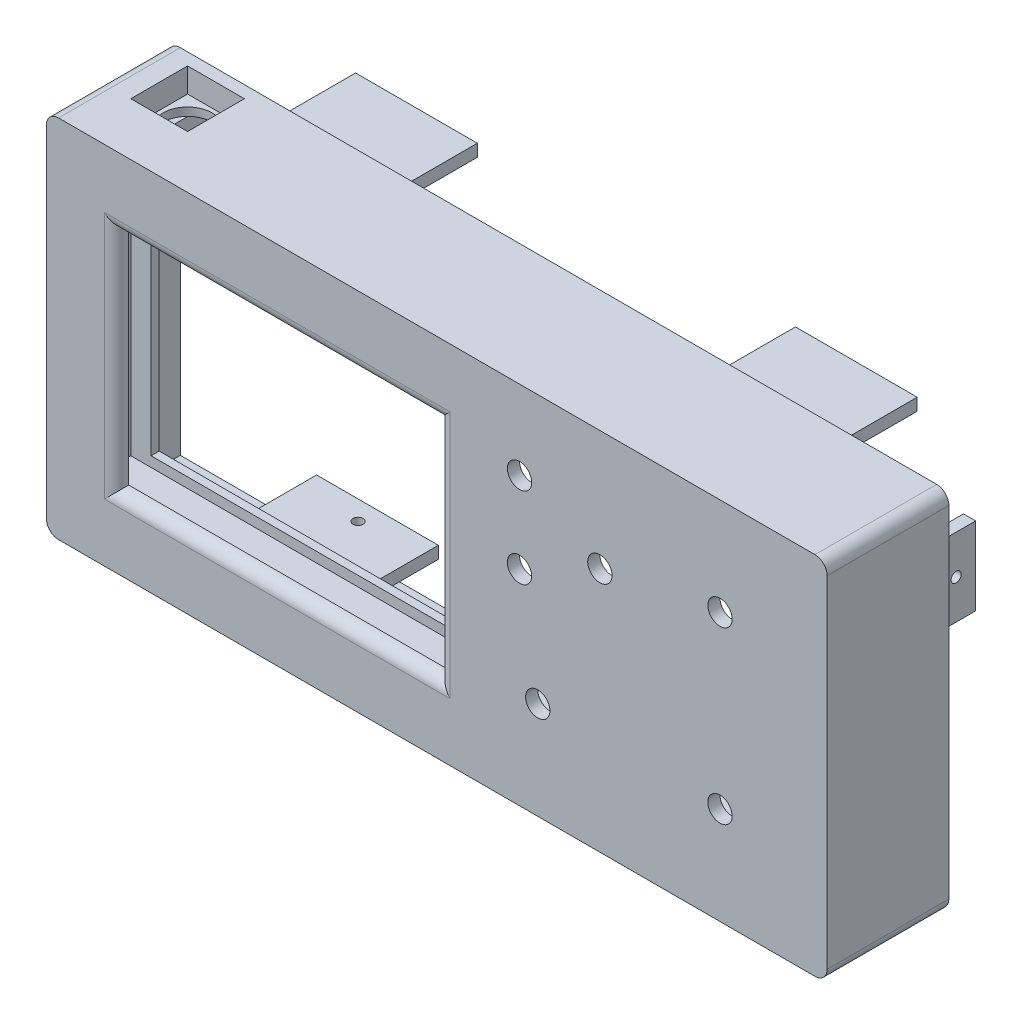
ISO-10303-21;
HEADER;
FILE_DESCRIPTION(('STEP AP214'),'2;1');
FILE_NAME('part.step','',(''),(''),'','','');
FILE_SCHEMA(('AUTOMOTIVE_DESIGN { 1 0 10303 214 1 1 1 1 }'));
ENDSEC;
DATA;
#1=APPLICATION_CONTEXT('core data for automotive mechanical design processes');
#2=APPLICATION_PROTOCOL_DEFINITION('international standard','automotive_design',2000,#1);
#3=PRODUCT_CONTEXT('',#1,'mechanical');
#4=PRODUCT('Part','Part','',(#3));
#5=PRODUCT_RELATED_PRODUCT_CATEGORY('part','',(#4));
#6=PRODUCT_DEFINITION_FORMATION('','',#4);
#7=PRODUCT_DEFINITION_CONTEXT('part definition',#1,'design');
#8=PRODUCT_DEFINITION('design','',#6,#7);
#9=PRODUCT_DEFINITION_SHAPE('','',#8);
#10=(LENGTH_UNIT() NAMED_UNIT(*) SI_UNIT(.MILLI.,.METRE.));
#11=(NAMED_UNIT(*) PLANE_ANGLE_UNIT() SI_UNIT($,.RADIAN.));
#12=(NAMED_UNIT(*) SI_UNIT($,.STERADIAN.) SOLID_ANGLE_UNIT());
#13=UNCERTAINTY_MEASURE_WITH_UNIT(LENGTH_MEASURE(1.E-05),#10,'distance_accuracy_value','');
#14=(GEOMETRIC_REPRESENTATION_CONTEXT(3) GLOBAL_UNCERTAINTY_ASSIGNED_CONTEXT((#13)) GLOBAL_UNIT_ASSIGNED_CONTEXT((#10,
#11,#12)) REPRESENTATION_CONTEXT('',''));
#15=CARTESIAN_POINT('',(0.,0.,0.));
#16=DIRECTION('',(0.,0.,1.));
#17=DIRECTION('',(1.,0.,0.));
#18=AXIS2_PLACEMENT_3D('',#15,#16,#17);
#19=CARTESIAN_POINT('',(189.4,87.,-3.));
#20=DIRECTION('',(0.,1.,0.));
#21=DIRECTION('',(0.,0.,1.));
#22=AXIS2_PLACEMENT_3D('',#19,#20,#21);
#23=PLANE('',#22);
#24=DIRECTION('',(0.,0.,1.));
#25=VECTOR('',#24,1.);
#26=CARTESIAN_POINT('',(27.,87.,-49.2));
#27=LINE('',#26,#25);
#28=CARTESIAN_POINT('',(27.,87.,-30.));
#29=VERTEX_POINT('',#28);
#30=CARTESIAN_POINT('',(27.,87.,-3.));
#31=VERTEX_POINT('',#30);
#32=EDGE_CURVE('E855',#29,#31,#27,.T.);
#33=ORIENTED_EDGE('',*,*,#32,.T.);
#34=DIRECTION('',(1.,0.,0.));
#35=VECTOR('',#34,1.);
#36=CARTESIAN_POINT('',(189.4,87.,-3.));
#37=LINE('',#36,#35);
#38=CARTESIAN_POINT('',(3.,87.,-3.));
#39=VERTEX_POINT('',#38);
#40=EDGE_CURVE('E915',#39,#31,#37,.T.);
#41=ORIENTED_EDGE('',*,*,#40,.F.);
#42=DIRECTION('',(0.,0.,-1.));
#43=VECTOR('',#42,1.);
#44=CARTESIAN_POINT('',(3.,87.,-3.));
#45=LINE('',#44,#43);
#46=CARTESIAN_POINT('',(3.,87.,-30.));
#47=VERTEX_POINT('',#46);
#48=EDGE_CURVE('E943',#39,#47,#45,.T.);
#49=ORIENTED_EDGE('',*,*,#48,.T.);
#50=DIRECTION('',(1.,0.,0.));
#51=VECTOR('',#50,1.);
#52=CARTESIAN_POINT('',(189.4,87.,-30.));
#53=LINE('',#52,#51);
#54=EDGE_CURVE('E933',#47,#29,#53,.T.);
#55=ORIENTED_EDGE('',*,*,#54,.T.);
#56=EDGE_LOOP('',(#33,#41,#49,#55));
#57=FACE_BOUND('',#56,.T.);
#58=DIRECTION('',(0.,0.,-1.));
#59=VECTOR('',#58,1.);
#60=CARTESIAN_POINT('',(6.36,87.,-3.));
#61=LINE('',#60,#59);
#62=CARTESIAN_POINT('',(6.36,87.,-11.56));
#63=VERTEX_POINT('',#62);
#64=CARTESIAN_POINT('',(6.36,87.,-28.44));
#65=VERTEX_POINT('',#64);
#66=EDGE_CURVE('E550',#63,#65,#61,.T.);
#67=ORIENTED_EDGE('',*,*,#66,.F.);
#68=DIRECTION('',(-1.,0.,0.));
#69=VECTOR('',#68,1.);
#70=CARTESIAN_POINT('',(189.4,87.,-11.56));
#71=LINE('',#70,#69);
#72=CARTESIAN_POINT('',(23.24,87.,-11.56));
#73=VERTEX_POINT('',#72);
#74=EDGE_CURVE('E536',#73,#63,#71,.T.);
#75=ORIENTED_EDGE('',*,*,#74,.F.);
#76=DIRECTION('',(0.,0.,-1.));
#77=VECTOR('',#76,1.);
#78=CARTESIAN_POINT('',(23.24,87.,-3.));
#79=LINE('',#78,#77);
#80=CARTESIAN_POINT('',(23.24,87.,-28.44));
#81=VERTEX_POINT('',#80);
#82=EDGE_CURVE('E547',#73,#81,#79,.T.);
#83=ORIENTED_EDGE('',*,*,#82,.T.);
#84=DIRECTION('',(-1.,0.,0.));
#85=VECTOR('',#84,1.);
#86=CARTESIAN_POINT('',(189.4,87.,-28.44));
#87=LINE('',#86,#85);
#88=EDGE_CURVE('E91',#81,#65,#87,.T.);
#89=ORIENTED_EDGE('',*,*,#88,.T.);
#90=EDGE_LOOP('',(#67,#75,#83,#89));
#91=FACE_BOUND('',#90,.T.);
#92=ADVANCED_FACE('F68',(#57,#91),#23,.F.);
#93=CARTESIAN_POINT('',(100.1,74.3,-12.5));
#94=DIRECTION('',(0.,1.,0.));
#95=DIRECTION('',(0.,0.,1.));
#96=AXIS2_PLACEMENT_3D('',#93,#94,#95);
#97=PLANE('',#96);
#98=DIRECTION('',(-1.,0.,0.));
#99=VECTOR('',#98,1.);
#100=CARTESIAN_POINT('',(15.3,74.3,-10.5));
#101=LINE('',#100,#99);
#102=CARTESIAN_POINT('',(100.1,74.3,-10.5));
#103=VERTEX_POINT('',#102);
#104=CARTESIAN_POINT('',(10.3,74.3,-10.5));
#105=VERTEX_POINT('',#104);
#106=EDGE_CURVE('E593',#103,#105,#101,.T.);
#107=ORIENTED_EDGE('',*,*,#106,.F.);
#108=DIRECTION('',(0.,0.,1.));
#109=VECTOR('',#108,1.);
#110=CARTESIAN_POINT('',(100.1,74.3,-12.5));
#111=LINE('',#110,#109);
#112=CARTESIAN_POINT('',(100.1,74.3,-3.));
#113=VERTEX_POINT('',#112);
#114=EDGE_CURVE('E584',#103,#113,#111,.T.);
#115=ORIENTED_EDGE('',*,*,#114,.T.);
#116=DIRECTION('',(-1.,0.,0.));
#117=VECTOR('',#116,1.);
#118=CARTESIAN_POINT('',(100.1,74.3,-3.));
#119=LINE('',#118,#117);
#120=CARTESIAN_POINT('',(10.3,74.3,-3.));
#121=VERTEX_POINT('',#120);
#122=EDGE_CURVE('E576',#113,#121,#119,.T.);
#123=ORIENTED_EDGE('',*,*,#122,.T.);
#124=DIRECTION('',(0.,0.,1.));
#125=VECTOR('',#124,1.);
#126=CARTESIAN_POINT('',(10.3,74.3,-12.5));
#127=LINE('',#126,#125);
#128=EDGE_CURVE('E636',#105,#121,#127,.T.);
#129=ORIENTED_EDGE('',*,*,#128,.F.);
#130=EDGE_LOOP('',(#107,#115,#123,#129));
#131=FACE_BOUND('',#130,.T.);
#132=ADVANCED_FACE('F1206',(#131),#97,.F.);
#133=CARTESIAN_POINT('',(0.,0.,-3.));
#134=DIRECTION('',(0.,0.,-1.));
#135=DIRECTION('',(-1.,0.,0.));
#136=AXIS2_PLACEMENT_3D('',#133,#134,#135);
#137=PLANE('',#136);
#138=CARTESIAN_POINT('',(121.1,24.,-3.));
#139=DIRECTION('',(0.,0.,-1.));
#140=DIRECTION('',(-1.,0.,0.));
#141=AXIS2_PLACEMENT_3D('',#138,#139,#140);
#142=CIRCLE('',#141,3.00000000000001);
#143=CARTESIAN_POINT('',(118.1,24.,-3.));
#144=VERTEX_POINT('',#143);
#145=EDGE_CURVE('E679',#144,#144,#142,.F.);
#146=ORIENTED_EDGE('',*,*,#145,.T.);
#147=EDGE_LOOP('',(#146));
#148=FACE_BOUND('',#147,.T.);
#149=CARTESIAN_POINT('',(116.6,50.5,-3.));
#150=DIRECTION('',(0.,0.,-1.));
#151=DIRECTION('',(-1.,0.,0.));
#152=AXIS2_PLACEMENT_3D('',#149,#150,#151);
#153=CIRCLE('',#152,3.00000000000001);
#154=CARTESIAN_POINT('',(113.6,50.5,-3.));
#155=VERTEX_POINT('',#154);
#156=EDGE_CURVE('E680',#155,#155,#153,.F.);
#157=ORIENTED_EDGE('',*,*,#156,.T.);
#158=EDGE_LOOP('',(#157));
#159=FACE_BOUND('',#158,.T.);
#160=CARTESIAN_POINT('',(136.4,60.5,-3.));
#161=DIRECTION('',(0.,0.,-1.));
#162=DIRECTION('',(-1.,0.,0.));
#163=AXIS2_PLACEMENT_3D('',#160,#161,#162);
#164=CIRCLE('',#163,2.99999999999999);
#165=CARTESIAN_POINT('',(133.4,60.5,-3.));
#166=VERTEX_POINT('',#165);
#167=EDGE_CURVE('E687',#166,#166,#164,.F.);
#168=ORIENTED_EDGE('',*,*,#167,.T.);
#169=EDGE_LOOP('',(#168));
#170=FACE_BOUND('',#169,.T.);
#171=CARTESIAN_POINT('',(166.,24.,-3.));
#172=DIRECTION('',(0.,0.,-1.));
#173=DIRECTION('',(-1.,0.,0.));
#174=AXIS2_PLACEMENT_3D('',#171,#172,#173);
#175=CIRCLE('',#174,2.99999999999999);
#176=CARTESIAN_POINT('',(163.,24.,-3.));
#177=VERTEX_POINT('',#176);
#178=EDGE_CURVE('E693',#177,#177,#175,.F.);
#179=ORIENTED_EDGE('',*,*,#178,.T.);
#180=EDGE_LOOP('',(#179));
#181=FACE_BOUND('',#180,.T.);
#182=CARTESIAN_POINT('',(166.,66.,-3.));
#183=DIRECTION('',(0.,0.,-1.));
#184=DIRECTION('',(-1.,0.,0.));
#185=AXIS2_PLACEMENT_3D('',#182,#183,#184);
#186=CIRCLE('',#185,2.99999999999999);
#187=CARTESIAN_POINT('',(163.,66.,-3.));
#188=VERTEX_POINT('',#187);
#189=EDGE_CURVE('E672',#188,#188,#186,.F.);
#190=ORIENTED_EDGE('',*,*,#189,.T.);
#191=EDGE_LOOP('',(#190));
#192=FACE_BOUND('',#191,.T.);
#193=CARTESIAN_POINT('',(116.6,70.5,-3.));
#194=DIRECTION('',(0.,0.,-1.));
#195=DIRECTION('',(-1.,0.,0.));
#196=AXIS2_PLACEMENT_3D('',#193,#194,#195);
#197=CIRCLE('',#196,3.00000000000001);
#198=CARTESIAN_POINT('',(113.6,70.5,-3.));
#199=VERTEX_POINT('',#198);
#200=EDGE_CURVE('E702',#199,#199,#197,.F.);
#201=ORIENTED_EDGE('',*,*,#200,.T.);
#202=EDGE_LOOP('',(#201));
#203=FACE_BOUND('',#202,.T.);
#204=DIRECTION('',(-1.,0.,0.));
#205=VECTOR('',#204,1.);
#206=CARTESIAN_POINT('',(17.3,72.5,-3.));
#207=LINE('',#206,#205);
#208=CARTESIAN_POINT('',(96.5,72.5,-3.));
#209=VERTEX_POINT('',#208);
#210=CARTESIAN_POINT('',(17.3,72.5,-3.));
#211=VERTEX_POINT('',#210);
#212=EDGE_CURVE('E898',#209,#211,#207,.T.);
#213=ORIENTED_EDGE('',*,*,#212,.T.);
#214=DIRECTION('',(0.,-1.,0.));
#215=VECTOR('',#214,1.);
#216=CARTESIAN_POINT('',(17.3,72.5,-3.));
#217=LINE('',#216,#215);
#218=CARTESIAN_POINT('',(17.3,17.3,-3.));
#219=VERTEX_POINT('',#218);
#220=EDGE_CURVE('E895',#211,#219,#217,.T.);
#221=ORIENTED_EDGE('',*,*,#220,.T.);
#222=DIRECTION('',(1.,0.,0.));
#223=VECTOR('',#222,1.);
#224=CARTESIAN_POINT('',(17.3,17.3,-3.));
#225=LINE('',#224,#223);
#226=CARTESIAN_POINT('',(96.5,17.3,-3.));
#227=VERTEX_POINT('',#226);
#228=EDGE_CURVE('E890',#219,#227,#225,.T.);
#229=ORIENTED_EDGE('',*,*,#228,.T.);
#230=DIRECTION('',(0.,1.,0.));
#231=VECTOR('',#230,1.);
#232=CARTESIAN_POINT('',(96.5,72.5,-3.));
#233=LINE('',#232,#231);
#234=EDGE_CURVE('E893',#227,#209,#233,.T.);
#235=ORIENTED_EDGE('',*,*,#234,.T.);
#236=EDGE_LOOP('',(#213,#221,#229,#235));
#237=FACE_BOUND('',#236,.T.);
#238=DIRECTION('',(0.,-1.,0.));
#239=VECTOR('',#238,1.);
#240=CARTESIAN_POINT('',(6.00000000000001,77.4,-3.));
#241=LINE('',#240,#239);
#242=CARTESIAN_POINT('',(6.00000000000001,77.4,-3.));
#243=VERTEX_POINT('',#242);
#244=CARTESIAN_POINT('',(6.00000000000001,58.2000000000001,-3.));
#245=VERTEX_POINT('',#244);
#246=EDGE_CURVE('E719',#243,#245,#241,.T.);
#247=ORIENTED_EDGE('',*,*,#246,.F.);
#248=DIRECTION('',(1.,0.,0.));
#249=VECTOR('',#248,1.);
#250=CARTESIAN_POINT('',(3.,77.4,-3.));
#251=LINE('',#250,#249);
#252=CARTESIAN_POINT('',(3.,77.4,-3.));
#253=VERTEX_POINT('',#252);
#254=EDGE_CURVE('E705',#253,#243,#251,.T.);
#255=ORIENTED_EDGE('',*,*,#254,.F.);
#256=DIRECTION('',(0.,1.,0.));
#257=VECTOR('',#256,1.);
#258=CARTESIAN_POINT('',(3.,87.,-3.));
#259=LINE('',#258,#257);
#260=EDGE_CURVE('E909',#253,#39,#259,.T.);
#261=ORIENTED_EDGE('',*,*,#260,.T.);
#262=ORIENTED_EDGE('',*,*,#40,.T.);
#263=DIRECTION('',(0.,1.,0.));
#264=VECTOR('',#263,1.);
#265=CARTESIAN_POINT('',(27.,87.,-3.));
#266=LINE('',#265,#264);
#267=CARTESIAN_POINT('',(27.,84.,-3.));
#268=VERTEX_POINT('',#267);
#269=EDGE_CURVE('E827',#268,#31,#266,.T.);
#270=ORIENTED_EDGE('',*,*,#269,.F.);
#271=DIRECTION('',(-1.,0.,0.));
#272=VECTOR('',#271,1.);
#273=CARTESIAN_POINT('',(27.,84.,-3.));
#274=LINE('',#273,#272);
#275=CARTESIAN_POINT('',(57.,84.,-3.));
#276=VERTEX_POINT('',#275);
#277=EDGE_CURVE('E832',#276,#268,#274,.T.);
#278=ORIENTED_EDGE('',*,*,#277,.F.);
#279=DIRECTION('',(0.,-1.,0.));
#280=VECTOR('',#279,1.);
#281=CARTESIAN_POINT('',(57.,87.,-3.));
#282=LINE('',#281,#280);
#283=CARTESIAN_POINT('',(57.,87.,-3.));
#284=VERTEX_POINT('',#283);
#285=EDGE_CURVE('E841',#284,#276,#282,.T.);
#286=ORIENTED_EDGE('',*,*,#285,.F.);
#287=CARTESIAN_POINT('',(135.4,87.,-3.));
#288=VERTEX_POINT('',#287);
#289=EDGE_CURVE('E919',#284,#288,#37,.T.);
#290=ORIENTED_EDGE('',*,*,#289,.T.);
#291=DIRECTION('',(0.,1.,0.));
#292=VECTOR('',#291,1.);
#293=CARTESIAN_POINT('',(135.4,87.,-3.));
#294=LINE('',#293,#292);
#295=CARTESIAN_POINT('',(135.4,84.,-3.));
#296=VERTEX_POINT('',#295);
#297=EDGE_CURVE('E864',#296,#288,#294,.T.);
#298=ORIENTED_EDGE('',*,*,#297,.F.);
#299=DIRECTION('',(-1.,0.,0.));
#300=VECTOR('',#299,1.);
#301=CARTESIAN_POINT('',(165.4,84.,-3.));
#302=LINE('',#301,#300);
#303=CARTESIAN_POINT('',(165.4,84.,-3.));
#304=VERTEX_POINT('',#303);
#305=EDGE_CURVE('E873',#304,#296,#302,.T.);
#306=ORIENTED_EDGE('',*,*,#305,.F.);
#307=DIRECTION('',(0.,-1.,0.));
#308=VECTOR('',#307,1.);
#309=CARTESIAN_POINT('',(165.4,87.,-3.));
#310=LINE('',#309,#308);
#311=CARTESIAN_POINT('',(165.4,87.,-3.));
#312=VERTEX_POINT('',#311);
#313=EDGE_CURVE('E859',#312,#304,#310,.T.);
#314=ORIENTED_EDGE('',*,*,#313,.F.);
#315=CARTESIAN_POINT('',(189.4,87.,-3.));
#316=VERTEX_POINT('',#315);
#317=EDGE_CURVE('E914',#312,#316,#37,.T.);
#318=ORIENTED_EDGE('',*,*,#317,.T.);
#319=DIRECTION('',(0.,-1.,0.));
#320=VECTOR('',#319,1.);
#321=CARTESIAN_POINT('',(189.4,87.,-3.));
#322=LINE('',#321,#320);
#323=CARTESIAN_POINT('',(189.4,77.4,-3.));
#324=VERTEX_POINT('',#323);
#325=EDGE_CURVE('E901',#316,#324,#322,.T.);
#326=ORIENTED_EDGE('',*,*,#325,.T.);
#327=DIRECTION('',(1.,0.,0.));
#328=VECTOR('',#327,1.);
#329=CARTESIAN_POINT('',(189.4,77.4,-3.));
#330=LINE('',#329,#328);
#331=CARTESIAN_POINT('',(186.4,77.4,-3.));
#332=VERTEX_POINT('',#331);
#333=EDGE_CURVE('E740',#332,#324,#330,.T.);
#334=ORIENTED_EDGE('',*,*,#333,.F.);
#335=DIRECTION('',(0.,1.,0.));
#336=VECTOR('',#335,1.);
#337=CARTESIAN_POINT('',(186.4,77.4,-3.));
#338=LINE('',#337,#336);
#339=CARTESIAN_POINT('',(186.4,58.2,-3.));
#340=VERTEX_POINT('',#339);
#341=EDGE_CURVE('E749',#340,#332,#338,.T.);
#342=ORIENTED_EDGE('',*,*,#341,.F.);
#343=DIRECTION('',(-1.,0.,0.));
#344=VECTOR('',#343,1.);
#345=CARTESIAN_POINT('',(189.4,58.2,-3.));
#346=LINE('',#345,#344);
#347=CARTESIAN_POINT('',(189.4,58.2,-3.));
#348=VERTEX_POINT('',#347);
#349=EDGE_CURVE('E735',#348,#340,#346,.T.);
#350=ORIENTED_EDGE('',*,*,#349,.F.);
#351=CARTESIAN_POINT('',(189.4,3.,-3.));
#352=VERTEX_POINT('',#351);
#353=EDGE_CURVE('E905',#348,#352,#322,.T.);
#354=ORIENTED_EDGE('',*,*,#353,.T.);
#355=DIRECTION('',(-1.,0.,0.));
#356=VECTOR('',#355,1.);
#357=CARTESIAN_POINT('',(189.4,3.,-3.));
#358=LINE('',#357,#356);
#359=CARTESIAN_POINT('',(165.4,3.,-3.));
#360=VERTEX_POINT('',#359);
#361=EDGE_CURVE('E906',#352,#360,#358,.T.);
#362=ORIENTED_EDGE('',*,*,#361,.T.);
#363=DIRECTION('',(0.,-1.,0.));
#364=VECTOR('',#363,1.);
#365=CARTESIAN_POINT('',(165.4,3.,-3.));
#366=LINE('',#365,#364);
#367=CARTESIAN_POINT('',(165.4,6.00000000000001,-3.));
#368=VERTEX_POINT('',#367);
#369=EDGE_CURVE('E797',#368,#360,#366,.T.);
#370=ORIENTED_EDGE('',*,*,#369,.F.);
#371=DIRECTION('',(1.,0.,0.));
#372=VECTOR('',#371,1.);
#373=CARTESIAN_POINT('',(165.4,6.00000000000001,-3.));
#374=LINE('',#373,#372);
#375=CARTESIAN_POINT('',(135.4,6.,-3.));
#376=VERTEX_POINT('',#375);
#377=EDGE_CURVE('E802',#376,#368,#374,.T.);
#378=ORIENTED_EDGE('',*,*,#377,.F.);
#379=DIRECTION('',(0.,1.,0.));
#380=VECTOR('',#379,1.);
#381=CARTESIAN_POINT('',(135.4,3.,-3.));
#382=LINE('',#381,#380);
#383=CARTESIAN_POINT('',(135.4,3.,-3.));
#384=VERTEX_POINT('',#383);
#385=EDGE_CURVE('E811',#384,#376,#382,.T.);
#386=ORIENTED_EDGE('',*,*,#385,.F.);
#387=CARTESIAN_POINT('',(57.,3.,-3.));
#388=VERTEX_POINT('',#387);
#389=EDGE_CURVE('E910',#384,#388,#358,.T.);
#390=ORIENTED_EDGE('',*,*,#389,.T.);
#391=DIRECTION('',(0.,-1.,0.));
#392=VECTOR('',#391,1.);
#393=CARTESIAN_POINT('',(57.,3.00000000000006,-3.));
#394=LINE('',#393,#392);
#395=CARTESIAN_POINT('',(57.,6.00000000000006,-3.));
#396=VERTEX_POINT('',#395);
#397=EDGE_CURVE('E770',#396,#388,#394,.T.);
#398=ORIENTED_EDGE('',*,*,#397,.F.);
#399=DIRECTION('',(1.,0.,0.));
#400=VECTOR('',#399,1.);
#401=CARTESIAN_POINT('',(27.,6.00000000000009,-3.));
#402=LINE('',#401,#400);
#403=CARTESIAN_POINT('',(27.,6.00000000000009,-3.));
#404=VERTEX_POINT('',#403);
#405=EDGE_CURVE('E779',#404,#396,#402,.T.);
#406=ORIENTED_EDGE('',*,*,#405,.F.);
#407=DIRECTION('',(0.,1.,0.));
#408=VECTOR('',#407,1.);
#409=CARTESIAN_POINT('',(27.,3.00000000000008,-3.));
#410=LINE('',#409,#408);
#411=CARTESIAN_POINT('',(27.,3.,-3.));
#412=VERTEX_POINT('',#411);
#413=EDGE_CURVE('E765',#412,#404,#410,.T.);
#414=ORIENTED_EDGE('',*,*,#413,.F.);
#415=CARTESIAN_POINT('',(3.,3.,-3.));
#416=VERTEX_POINT('',#415);
#417=EDGE_CURVE('E904',#412,#416,#358,.T.);
#418=ORIENTED_EDGE('',*,*,#417,.T.);
#419=CARTESIAN_POINT('',(3.,58.2000000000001,-3.));
#420=VERTEX_POINT('',#419);
#421=EDGE_CURVE('E911',#416,#420,#259,.T.);
#422=ORIENTED_EDGE('',*,*,#421,.T.);
#423=DIRECTION('',(-1.,0.,0.));
#424=VECTOR('',#423,1.);
#425=CARTESIAN_POINT('',(3.,58.2000000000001,-3.));
#426=LINE('',#425,#424);
#427=EDGE_CURVE('E710',#245,#420,#426,.T.);
#428=ORIENTED_EDGE('',*,*,#427,.F.);
#429=EDGE_LOOP('',(#247,#255,#261,#262,#270,#278,#286,#290,#298,#306,#314,#318,#326,#334,#342,
#350,#354,#362,#370,#378,#386,#390,#398,#406,#414,#418,#422,#428));
#430=FACE_BOUND('',#429,.T.);
#431=DIRECTION('',(0.,-1.,0.));
#432=VECTOR('',#431,1.);
#433=CARTESIAN_POINT('',(10.3,74.3,-3.));
#434=LINE('',#433,#432);
#435=CARTESIAN_POINT('',(10.3,16.3,-3.));
#436=VERTEX_POINT('',#435);
#437=EDGE_CURVE('E637',#121,#436,#434,.T.);
#438=ORIENTED_EDGE('',*,*,#437,.F.);
#439=ORIENTED_EDGE('',*,*,#122,.F.);
#440=DIRECTION('',(0.,-1.,0.));
#441=VECTOR('',#440,1.);
#442=CARTESIAN_POINT('',(100.1,76.3,-3.));
#443=LINE('',#442,#441);
#444=CARTESIAN_POINT('',(100.1,76.3,-3.));
#445=VERTEX_POINT('',#444);
#446=EDGE_CURVE('E567',#445,#113,#443,.T.);
#447=ORIENTED_EDGE('',*,*,#446,.F.);
#448=DIRECTION('',(1.,0.,0.));
#449=VECTOR('',#448,1.);
#450=CARTESIAN_POINT('',(100.1,76.3,-3.));
#451=LINE('',#450,#449);
#452=CARTESIAN_POINT('',(8.3,76.3,-3.));
#453=VERTEX_POINT('',#452);
#454=EDGE_CURVE('E571',#453,#445,#451,.T.);
#455=ORIENTED_EDGE('',*,*,#454,.F.);
#456=DIRECTION('',(0.,-1.,0.));
#457=VECTOR('',#456,1.);
#458=CARTESIAN_POINT('',(8.3,74.3,-3.));
#459=LINE('',#458,#457);
#460=CARTESIAN_POINT('',(8.29999999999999,13.3,-3.));
#461=VERTEX_POINT('',#460);
#462=EDGE_CURVE('E612',#453,#461,#459,.T.);
#463=ORIENTED_EDGE('',*,*,#462,.T.);
#464=DIRECTION('',(-1.,0.,0.));
#465=VECTOR('',#464,1.);
#466=CARTESIAN_POINT('',(0.,13.3,-3.));
#467=LINE('',#466,#465);
#468=CARTESIAN_POINT('',(100.1,13.3,-3.));
#469=VERTEX_POINT('',#468);
#470=EDGE_CURVE('E616',#469,#461,#467,.T.);
#471=ORIENTED_EDGE('',*,*,#470,.F.);
#472=DIRECTION('',(0.,-1.,0.));
#473=VECTOR('',#472,1.);
#474=CARTESIAN_POINT('',(100.1,0.,-3.));
#475=LINE('',#474,#473);
#476=CARTESIAN_POINT('',(100.1,16.3,-3.));
#477=VERTEX_POINT('',#476);
#478=EDGE_CURVE('E622',#477,#469,#475,.T.);
#479=ORIENTED_EDGE('',*,*,#478,.F.);
#480=DIRECTION('',(-1.,0.,0.));
#481=VECTOR('',#480,1.);
#482=CARTESIAN_POINT('',(0.,16.3,-3.));
#483=LINE('',#482,#481);
#484=EDGE_CURVE('E619',#477,#436,#483,.T.);
#485=ORIENTED_EDGE('',*,*,#484,.T.);
#486=EDGE_LOOP('',(#438,#439,#447,#455,#463,#471,#479,#485));
#487=FACE_BOUND('',#486,.T.);
#488=ADVANCED_FACE('F1065',(#148,#159,#170,#181,#192,#203,#237,#430,#487),#137,.T.);
#489=CARTESIAN_POINT('',(10.3,74.3,-12.5));
#490=DIRECTION('',(-1.,0.,0.));
#491=DIRECTION('',(0.,0.,1.));
#492=AXIS2_PLACEMENT_3D('',#489,#490,#491);
#493=PLANE('',#492);
#494=DIRECTION('',(0.,-1.,0.));
#495=VECTOR('',#494,1.);
#496=CARTESIAN_POINT('',(10.3,18.8,-10.5));
#497=LINE('',#496,#495);
#498=CARTESIAN_POINT('',(10.3,16.3,-10.5));
#499=VERTEX_POINT('',#498);
#500=EDGE_CURVE('E609',#105,#499,#497,.T.);
#501=ORIENTED_EDGE('',*,*,#500,.F.);
#502=ORIENTED_EDGE('',*,*,#128,.T.);
#503=ORIENTED_EDGE('',*,*,#437,.T.);
#504=DIRECTION('',(0.,0.,1.));
#505=VECTOR('',#504,1.);
#506=CARTESIAN_POINT('',(10.3,16.3,-12.5));
#507=LINE('',#506,#505);
#508=EDGE_CURVE('E630',#499,#436,#507,.T.);
#509=ORIENTED_EDGE('',*,*,#508,.F.);
#510=EDGE_LOOP('',(#501,#502,#503,#509));
#511=FACE_BOUND('',#510,.T.);
#512=ADVANCED_FACE('F1599',(#511),#493,.F.);
#513=CARTESIAN_POINT('',(0.,18.8,0.));
#514=DIRECTION('',(0.,-1.,0.));
#515=DIRECTION('',(0.,0.,-1.));
#516=AXIS2_PLACEMENT_3D('',#513,#514,#515);
#517=PLANE('',#516);
#518=DIRECTION('',(0.,0.,-1.));
#519=VECTOR('',#518,1.);
#520=CARTESIAN_POINT('',(15.3,18.8,-12.5));
#521=LINE('',#520,#519);
#522=CARTESIAN_POINT('',(15.3,18.8,-10.5));
#523=VERTEX_POINT('',#522);
#524=CARTESIAN_POINT('',(15.3,18.8,-12.5));
#525=VERTEX_POINT('',#524);
#526=EDGE_CURVE('E590',#523,#525,#521,.T.);
#527=ORIENTED_EDGE('',*,*,#526,.F.);
#528=DIRECTION('',(1.,0.,0.));
#529=VECTOR('',#528,1.);
#530=CARTESIAN_POINT('',(100.1,18.8,-10.5));
#531=LINE('',#530,#529);
#532=CARTESIAN_POINT('',(100.1,18.8,-10.5));
#533=VERTEX_POINT('',#532);
#534=EDGE_CURVE('E602',#523,#533,#531,.T.);
#535=ORIENTED_EDGE('',*,*,#534,.T.);
#536=DIRECTION('',(0.,0.,-1.));
#537=VECTOR('',#536,1.);
#538=CARTESIAN_POINT('',(100.1,18.8,-12.5));
#539=LINE('',#538,#537);
#540=CARTESIAN_POINT('',(100.1,18.8,-12.5));
#541=VERTEX_POINT('',#540);
#542=EDGE_CURVE('E597',#533,#541,#539,.T.);
#543=ORIENTED_EDGE('',*,*,#542,.T.);
#544=DIRECTION('',(-1.,0.,0.));
#545=VECTOR('',#544,1.);
#546=CARTESIAN_POINT('',(100.1,18.8,-12.5));
#547=LINE('',#546,#545);
#548=EDGE_CURVE('E600',#541,#525,#547,.T.);
#549=ORIENTED_EDGE('',*,*,#548,.T.);
#550=EDGE_LOOP('',(#527,#535,#543,#549));
#551=FACE_BOUND('',#550,.T.);
#552=ADVANCED_FACE('F1577',(#551),#517,.F.);
#553=CARTESIAN_POINT('',(0.,16.3,-12.5));
#554=DIRECTION('',(0.,1.,0.));
#555=DIRECTION('',(0.,0.,1.));
#556=AXIS2_PLACEMENT_3D('',#553,#554,#555);
#557=PLANE('',#556);
#558=DIRECTION('',(0.,0.,1.));
#559=VECTOR('',#558,1.);
#560=CARTESIAN_POINT('',(100.1,16.3,-12.5));
#561=LINE('',#560,#559);
#562=CARTESIAN_POINT('',(100.1,16.3,-10.5));
#563=VERTEX_POINT('',#562);
#564=EDGE_CURVE('E628',#563,#477,#561,.T.);
#565=ORIENTED_EDGE('',*,*,#564,.F.);
#566=DIRECTION('',(1.,0.,0.));
#567=VECTOR('',#566,1.);
#568=CARTESIAN_POINT('',(100.1,16.3,-10.5));
#569=LINE('',#568,#567);
#570=EDGE_CURVE('E596',#499,#563,#569,.T.);
#571=ORIENTED_EDGE('',*,*,#570,.F.);
#572=ORIENTED_EDGE('',*,*,#508,.T.);
#573=ORIENTED_EDGE('',*,*,#484,.F.);
#574=EDGE_LOOP('',(#565,#571,#572,#573));
#575=FACE_BOUND('',#574,.T.);
#576=ADVANCED_FACE('F1572',(#575),#557,.T.);
#577=CARTESIAN_POINT('',(3.,87.,-3.));
#578=DIRECTION('',(-1.,0.,0.));
#579=DIRECTION('',(0.,0.,1.));
#580=AXIS2_PLACEMENT_3D('',#577,#578,#579);
#581=PLANE('',#580);
#582=DIRECTION('',(0.,0.,1.));
#583=VECTOR('',#582,1.);
#584=CARTESIAN_POINT('',(3.,77.4,-3.));
#585=LINE('',#584,#583);
#586=CARTESIAN_POINT('',(3.,77.4,-30.));
#587=VERTEX_POINT('',#586);
#588=EDGE_CURVE('E12',#587,#253,#585,.T.);
#589=ORIENTED_EDGE('',*,*,#588,.F.);
#590=DIRECTION('',(0.,1.,0.));
#591=VECTOR('',#590,1.);
#592=CARTESIAN_POINT('',(3.,87.,-30.));
#593=LINE('',#592,#591);
#594=EDGE_CURVE('E927',#587,#47,#593,.T.);
#595=ORIENTED_EDGE('',*,*,#594,.T.);
#596=ORIENTED_EDGE('',*,*,#48,.F.);
#597=ORIENTED_EDGE('',*,*,#260,.F.);
#598=EDGE_LOOP('',(#589,#595,#596,#597));
#599=FACE_BOUND('',#598,.T.);
#600=ADVANCED_FACE('F1072',(#599),#581,.F.);
#601=DIRECTION('',(0.,0.,-1.));
#602=VECTOR('',#601,1.);
#603=CARTESIAN_POINT('',(3.,58.2000000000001,-3.));
#604=LINE('',#603,#602);
#605=CARTESIAN_POINT('',(3.,58.2000000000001,-30.));
#606=VERTEX_POINT('',#605);
#607=EDGE_CURVE('E76',#420,#606,#604,.T.);
#608=ORIENTED_EDGE('',*,*,#607,.F.);
#609=ORIENTED_EDGE('',*,*,#421,.F.);
#610=DIRECTION('',(0.,0.,-1.));
#611=VECTOR('',#610,1.);
#612=CARTESIAN_POINT('',(3.,3.,-3.));
#613=LINE('',#612,#611);
#614=CARTESIAN_POINT('',(3.,3.,-30.));
#615=VERTEX_POINT('',#614);
#616=EDGE_CURVE('E946',#416,#615,#613,.T.);
#617=ORIENTED_EDGE('',*,*,#616,.T.);
#618=EDGE_CURVE('E929',#615,#606,#593,.T.);
#619=ORIENTED_EDGE('',*,*,#618,.T.);
#620=EDGE_LOOP('',(#608,#609,#617,#619));
#621=FACE_BOUND('',#620,.T.);
#622=ADVANCED_FACE('F1180',(#621),#581,.F.);
#623=CARTESIAN_POINT('',(189.4,87.,-3.));
#624=DIRECTION('',(1.,0.,0.));
#625=DIRECTION('',(0.,0.,-1.));
#626=AXIS2_PLACEMENT_3D('',#623,#624,#625);
#627=PLANE('',#626);
#628=DIRECTION('',(0.,0.,1.));
#629=VECTOR('',#628,1.);
#630=CARTESIAN_POINT('',(189.4,58.2,-3.));
#631=LINE('',#630,#629);
#632=CARTESIAN_POINT('',(189.4,58.2,-30.));
#633=VERTEX_POINT('',#632);
#634=EDGE_CURVE('E1042',#633,#348,#631,.T.);
#635=ORIENTED_EDGE('',*,*,#634,.F.);
#636=DIRECTION('',(0.,-1.,0.));
#637=VECTOR('',#636,1.);
#638=CARTESIAN_POINT('',(189.4,87.,-30.));
#639=LINE('',#638,#637);
#640=CARTESIAN_POINT('',(189.4,3.,-30.));
#641=VERTEX_POINT('',#640);
#642=EDGE_CURVE('E897',#633,#641,#639,.T.);
#643=ORIENTED_EDGE('',*,*,#642,.T.);
#644=DIRECTION('',(0.,0.,-1.));
#645=VECTOR('',#644,1.);
#646=CARTESIAN_POINT('',(189.4,3.,-3.));
#647=LINE('',#646,#645);
#648=EDGE_CURVE('E918',#352,#641,#647,.T.);
#649=ORIENTED_EDGE('',*,*,#648,.F.);
#650=ORIENTED_EDGE('',*,*,#353,.F.);
#651=EDGE_LOOP('',(#635,#643,#649,#650));
#652=FACE_BOUND('',#651,.T.);
#653=ADVANCED_FACE('F1138',(#652),#627,.F.);
#654=DIRECTION('',(0.,0.,-1.));
#655=VECTOR('',#654,1.);
#656=CARTESIAN_POINT('',(189.4,77.4,-3.));
#657=LINE('',#656,#655);
#658=CARTESIAN_POINT('',(189.4,77.4,-30.));
#659=VERTEX_POINT('',#658);
#660=EDGE_CURVE('E1039',#324,#659,#657,.T.);
#661=ORIENTED_EDGE('',*,*,#660,.F.);
#662=ORIENTED_EDGE('',*,*,#325,.F.);
#663=DIRECTION('',(0.,0.,-1.));
#664=VECTOR('',#663,1.);
#665=CARTESIAN_POINT('',(189.4,87.,-3.));
#666=LINE('',#665,#664);
#667=CARTESIAN_POINT('',(189.4,87.,-30.));
#668=VERTEX_POINT('',#667);
#669=EDGE_CURVE('E939',#316,#668,#666,.T.);
#670=ORIENTED_EDGE('',*,*,#669,.T.);
#671=EDGE_CURVE('E920',#668,#659,#639,.T.);
#672=ORIENTED_EDGE('',*,*,#671,.T.);
#673=EDGE_LOOP('',(#661,#662,#670,#672));
#674=FACE_BOUND('',#673,.T.);
#675=ADVANCED_FACE('F1115',(#674),#627,.F.);
#676=CARTESIAN_POINT('',(189.4,3.,-3.));
#677=DIRECTION('',(0.,-1.,0.));
#678=DIRECTION('',(0.,0.,-1.));
#679=AXIS2_PLACEMENT_3D('',#676,#677,#678);
#680=PLANE('',#679);
#681=DIRECTION('',(0.,0.,1.));
#682=VECTOR('',#681,1.);
#683=CARTESIAN_POINT('',(27.,3.00000000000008,-39.6));
#684=LINE('',#683,#682);
#685=CARTESIAN_POINT('',(27.,3.00000000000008,-30.));
#686=VERTEX_POINT('',#685);
#687=EDGE_CURVE('E793',#686,#412,#684,.T.);
#688=ORIENTED_EDGE('',*,*,#687,.F.);
#689=DIRECTION('',(-1.,0.,0.));
#690=VECTOR('',#689,1.);
#691=CARTESIAN_POINT('',(189.4,3.,-30.));
#692=LINE('',#691,#690);
#693=EDGE_CURVE('E922',#686,#615,#692,.T.);
#694=ORIENTED_EDGE('',*,*,#693,.T.);
#695=ORIENTED_EDGE('',*,*,#616,.F.);
#696=ORIENTED_EDGE('',*,*,#417,.F.);
#697=EDGE_LOOP('',(#688,#694,#695,#696));
#698=FACE_BOUND('',#697,.T.);
#699=ADVANCED_FACE('F1177',(#698),#680,.F.);
#700=DIRECTION('',(0.,0.,1.));
#701=VECTOR('',#700,1.);
#702=CARTESIAN_POINT('',(57.,3.00000000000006,-39.6));
#703=LINE('',#702,#701);
#704=CARTESIAN_POINT('',(57.,3.,-30.));
#705=VERTEX_POINT('',#704);
#706=EDGE_CURVE('E776',#705,#388,#703,.T.);
#707=ORIENTED_EDGE('',*,*,#706,.T.);
#708=ORIENTED_EDGE('',*,*,#389,.F.);
#709=DIRECTION('',(0.,0.,1.));
#710=VECTOR('',#709,1.);
#711=CARTESIAN_POINT('',(135.4,3.,-3.));
#712=LINE('',#711,#710);
#713=CARTESIAN_POINT('',(135.4,3.,-30.));
#714=VERTEX_POINT('',#713);
#715=EDGE_CURVE('E1033',#714,#384,#712,.T.);
#716=ORIENTED_EDGE('',*,*,#715,.F.);
#717=EDGE_CURVE('E1168',#714,#705,#692,.T.);
#718=ORIENTED_EDGE('',*,*,#717,.T.);
#719=EDGE_LOOP('',(#707,#708,#716,#718));
#720=FACE_BOUND('',#719,.T.);
#721=ADVANCED_FACE('F1167',(#720),#680,.F.);
#722=DIRECTION('',(0.,0.,-1.));
#723=VECTOR('',#722,1.);
#724=CARTESIAN_POINT('',(165.4,3.,-3.));
#725=LINE('',#724,#723);
#726=CARTESIAN_POINT('',(165.4,3.,-30.));
#727=VERTEX_POINT('',#726);
#728=EDGE_CURVE('E1036',#360,#727,#725,.T.);
#729=ORIENTED_EDGE('',*,*,#728,.F.);
#730=ORIENTED_EDGE('',*,*,#361,.F.);
#731=ORIENTED_EDGE('',*,*,#648,.T.);
#732=EDGE_CURVE('E924',#641,#727,#692,.T.);
#733=ORIENTED_EDGE('',*,*,#732,.T.);
#734=EDGE_LOOP('',(#729,#730,#731,#733));
#735=FACE_BOUND('',#734,.T.);
#736=ADVANCED_FACE('F1144',(#735),#680,.F.);
#737=DIRECTION('',(0.,0.,1.));
#738=VECTOR('',#737,1.);
#739=CARTESIAN_POINT('',(57.,87.,-49.2));
#740=LINE('',#739,#738);
#741=CARTESIAN_POINT('',(57.,87.,-30.));
#742=VERTEX_POINT('',#741);
#743=EDGE_CURVE('E851',#742,#284,#740,.T.);
#744=ORIENTED_EDGE('',*,*,#743,.F.);
#745=CARTESIAN_POINT('',(135.4,87.,-30.));
#746=VERTEX_POINT('',#745);
#747=EDGE_CURVE('E937',#742,#746,#53,.T.);
#748=ORIENTED_EDGE('',*,*,#747,.T.);
#749=DIRECTION('',(0.,0.,-1.));
#750=VECTOR('',#749,1.);
#751=CARTESIAN_POINT('',(135.4,87.,-3.));
#752=LINE('',#751,#750);
#753=EDGE_CURVE('E1027',#288,#746,#752,.T.);
#754=ORIENTED_EDGE('',*,*,#753,.F.);
#755=ORIENTED_EDGE('',*,*,#289,.F.);
#756=EDGE_LOOP('',(#744,#748,#754,#755));
#757=FACE_BOUND('',#756,.T.);
#758=ADVANCED_FACE('F1105',(#757),#23,.F.);
#759=DIRECTION('',(0.,0.,1.));
#760=VECTOR('',#759,1.);
#761=CARTESIAN_POINT('',(165.4,87.,-3.));
#762=LINE('',#761,#760);
#763=CARTESIAN_POINT('',(165.4,87.,-30.));
#764=VERTEX_POINT('',#763);
#765=EDGE_CURVE('E1030',#764,#312,#762,.T.);
#766=ORIENTED_EDGE('',*,*,#765,.F.);
#767=EDGE_CURVE('E931',#764,#668,#53,.T.);
#768=ORIENTED_EDGE('',*,*,#767,.T.);
#769=ORIENTED_EDGE('',*,*,#669,.F.);
#770=ORIENTED_EDGE('',*,*,#317,.F.);
#771=EDGE_LOOP('',(#766,#768,#769,#770));
#772=FACE_BOUND('',#771,.T.);
#773=ADVANCED_FACE('F1112',(#772),#23,.F.);
#774=CARTESIAN_POINT('',(0.,0.,-30.));
#775=DIRECTION('',(-1.,0.,0.));
#776=DIRECTION('',(0.,0.,1.));
#777=AXIS2_PLACEMENT_3D('',#774,#775,#776);
#778=PLANE('',#777);
#779=DIRECTION('',(0.,-1.,0.));
#780=VECTOR('',#779,1.);
#781=CARTESIAN_POINT('',(0.,0.,-30.));
#782=LINE('',#781,#780);
#783=CARTESIAN_POINT('',(0.,87.,-30.));
#784=VERTEX_POINT('',#783);
#785=CARTESIAN_POINT('',(0.,3.,-30.));
#786=VERTEX_POINT('',#785);
#787=EDGE_CURVE('E951',#784,#786,#782,.T.);
#788=ORIENTED_EDGE('',*,*,#787,.T.);
#789=DIRECTION('',(0.,0.,1.));
#790=VECTOR('',#789,1.);
#791=CARTESIAN_POINT('',(0.,3.,-30.));
#792=LINE('',#791,#790);
#793=CARTESIAN_POINT('',(0.,3.,0.));
#794=VERTEX_POINT('',#793);
#795=EDGE_CURVE('E993',#786,#794,#792,.T.);
#796=ORIENTED_EDGE('',*,*,#795,.T.);
#797=DIRECTION('',(0.,-1.,0.));
#798=VECTOR('',#797,1.);
#799=CARTESIAN_POINT('',(0.,0.,0.));
#800=LINE('',#799,#798);
#801=CARTESIAN_POINT('',(0.,87.,0.));
#802=VERTEX_POINT('',#801);
#803=EDGE_CURVE('E942',#802,#794,#800,.T.);
#804=ORIENTED_EDGE('',*,*,#803,.F.);
#805=DIRECTION('',(0.,0.,1.));
#806=VECTOR('',#805,1.);
#807=CARTESIAN_POINT('',(0.,87.,-30.));
#808=LINE('',#807,#806);
#809=EDGE_CURVE('E983',#802,#784,#808,.F.);
#810=ORIENTED_EDGE('',*,*,#809,.T.);
#811=EDGE_LOOP('',(#788,#796,#804,#810));
#812=FACE_BOUND('',#811,.T.);
#813=ADVANCED_FACE('F1217',(#812),#778,.T.);
#814=CARTESIAN_POINT('',(0.,90.,-30.));
#815=DIRECTION('',(0.,1.,0.));
#816=DIRECTION('',(0.,0.,1.));
#817=AXIS2_PLACEMENT_3D('',#814,#815,#816);
#818=PLANE('',#817);
#819=DIRECTION('',(0.,0.,-1.));
#820=VECTOR('',#819,1.);
#821=CARTESIAN_POINT('',(21.8,90.,-13.));
#822=LINE('',#821,#820);
#823=CARTESIAN_POINT('',(21.8,90.,-13.));
#824=VERTEX_POINT('',#823);
#825=CARTESIAN_POINT('',(21.8,90.,-27.));
#826=VERTEX_POINT('',#825);
#827=EDGE_CURVE('E83',#824,#826,#822,.T.);
#828=ORIENTED_EDGE('',*,*,#827,.F.);
#829=DIRECTION('',(1.,0.,0.));
#830=VECTOR('',#829,1.);
#831=CARTESIAN_POINT('',(21.8,90.,-13.));
#832=LINE('',#831,#830);
#833=CARTESIAN_POINT('',(7.8,90.,-13.));
#834=VERTEX_POINT('',#833);
#835=EDGE_CURVE('E501',#834,#824,#832,.T.);
#836=ORIENTED_EDGE('',*,*,#835,.F.);
#837=DIRECTION('',(0.,0.,1.));
#838=VECTOR('',#837,1.);
#839=CARTESIAN_POINT('',(7.8,90.,-13.));
#840=LINE('',#839,#838);
#841=CARTESIAN_POINT('',(7.8,90.,-27.));
#842=VERTEX_POINT('',#841);
#843=EDGE_CURVE('E504',#842,#834,#840,.T.);
#844=ORIENTED_EDGE('',*,*,#843,.F.);
#845=DIRECTION('',(-1.,0.,0.));
#846=VECTOR('',#845,1.);
#847=CARTESIAN_POINT('',(21.8,90.,-27.));
#848=LINE('',#847,#846);
#849=EDGE_CURVE('E513',#826,#842,#848,.T.);
#850=ORIENTED_EDGE('',*,*,#849,.F.);
#851=EDGE_LOOP('',(#828,#836,#844,#850));
#852=FACE_BOUND('',#851,.T.);
#853=DIRECTION('',(-1.,0.,0.));
#854=VECTOR('',#853,1.);
#855=CARTESIAN_POINT('',(0.,90.,0.));
#856=LINE('',#855,#854);
#857=CARTESIAN_POINT('',(189.4,90.,0.));
#858=VERTEX_POINT('',#857);
#859=CARTESIAN_POINT('',(3.,90.,0.));
#860=VERTEX_POINT('',#859);
#861=EDGE_CURVE('E955',#858,#860,#856,.T.);
#862=ORIENTED_EDGE('',*,*,#861,.F.);
#863=DIRECTION('',(0.,0.,1.));
#864=VECTOR('',#863,1.);
#865=CARTESIAN_POINT('',(189.4,90.,-30.));
#866=LINE('',#865,#864);
#867=CARTESIAN_POINT('',(189.4,90.,-30.));
#868=VERTEX_POINT('',#867);
#869=EDGE_CURVE('E1025',#858,#868,#866,.F.);
#870=ORIENTED_EDGE('',*,*,#869,.T.);
#871=DIRECTION('',(-1.,0.,0.));
#872=VECTOR('',#871,1.);
#873=CARTESIAN_POINT('',(0.,90.,-30.));
#874=LINE('',#873,#872);
#875=CARTESIAN_POINT('',(3.,90.,-30.));
#876=VERTEX_POINT('',#875);
#877=EDGE_CURVE('E961',#868,#876,#874,.T.);
#878=ORIENTED_EDGE('',*,*,#877,.T.);
#879=DIRECTION('',(0.,0.,1.));
#880=VECTOR('',#879,1.);
#881=CARTESIAN_POINT('',(3.,90.,-30.));
#882=LINE('',#881,#880);
#883=EDGE_CURVE('E1022',#876,#860,#882,.T.);
#884=ORIENTED_EDGE('',*,*,#883,.T.);
#885=EDGE_LOOP('',(#862,#870,#878,#884));
#886=FACE_BOUND('',#885,.T.);
#887=ADVANCED_FACE('F1221',(#852,#886),#818,.T.);
#888=CARTESIAN_POINT('',(192.4,0.,-30.));
#889=DIRECTION('',(1.,0.,0.));
#890=DIRECTION('',(0.,0.,-1.));
#891=AXIS2_PLACEMENT_3D('',#888,#889,#890);
#892=PLANE('',#891);
#893=DIRECTION('',(0.,1.,0.));
#894=VECTOR('',#893,1.);
#895=CARTESIAN_POINT('',(192.4,0.,0.));
#896=LINE('',#895,#894);
#897=CARTESIAN_POINT('',(192.4,3.,0.));
#898=VERTEX_POINT('',#897);
#899=CARTESIAN_POINT('',(192.4,87.,0.));
#900=VERTEX_POINT('',#899);
#901=EDGE_CURVE('E970',#898,#900,#896,.T.);
#902=ORIENTED_EDGE('',*,*,#901,.F.);
#903=DIRECTION('',(0.,0.,1.));
#904=VECTOR('',#903,1.);
#905=CARTESIAN_POINT('',(192.4,3.,-30.));
#906=LINE('',#905,#904);
#907=CARTESIAN_POINT('',(192.4,3.,-30.));
#908=VERTEX_POINT('',#907);
#909=EDGE_CURVE('E1020',#898,#908,#906,.F.);
#910=ORIENTED_EDGE('',*,*,#909,.T.);
#911=DIRECTION('',(0.,1.,0.));
#912=VECTOR('',#911,1.);
#913=CARTESIAN_POINT('',(192.4,0.,-30.));
#914=LINE('',#913,#912);
#915=CARTESIAN_POINT('',(192.4,87.,-30.));
#916=VERTEX_POINT('',#915);
#917=EDGE_CURVE('E958',#908,#916,#914,.T.);
#918=ORIENTED_EDGE('',*,*,#917,.T.);
#919=DIRECTION('',(0.,0.,1.));
#920=VECTOR('',#919,1.);
#921=CARTESIAN_POINT('',(192.4,87.,-30.));
#922=LINE('',#921,#920);
#923=EDGE_CURVE('E1017',#916,#900,#922,.T.);
#924=ORIENTED_EDGE('',*,*,#923,.T.);
#925=EDGE_LOOP('',(#902,#910,#918,#924));
#926=FACE_BOUND('',#925,.T.);
#927=ADVANCED_FACE('F1227',(#926),#892,.T.);
#928=CARTESIAN_POINT('',(0.,0.,-30.));
#929=DIRECTION('',(0.,-1.,0.));
#930=DIRECTION('',(0.,0.,-1.));
#931=AXIS2_PLACEMENT_3D('',#928,#929,#930);
#932=PLANE('',#931);
#933=DIRECTION('',(1.,0.,0.));
#934=VECTOR('',#933,1.);
#935=CARTESIAN_POINT('',(0.,0.,0.));
#936=LINE('',#935,#934);
#937=CARTESIAN_POINT('',(3.,0.,0.));
#938=VERTEX_POINT('',#937);
#939=CARTESIAN_POINT('',(189.4,0.,0.));
#940=VERTEX_POINT('',#939);
#941=EDGE_CURVE('E967',#938,#940,#936,.T.);
#942=ORIENTED_EDGE('',*,*,#941,.F.);
#943=DIRECTION('',(0.,0.,1.));
#944=VECTOR('',#943,1.);
#945=CARTESIAN_POINT('',(3.,0.,-30.));
#946=LINE('',#945,#944);
#947=CARTESIAN_POINT('',(3.,0.,-30.));
#948=VERTEX_POINT('',#947);
#949=EDGE_CURVE('E1007',#938,#948,#946,.F.);
#950=ORIENTED_EDGE('',*,*,#949,.T.);
#951=DIRECTION('',(1.,0.,0.));
#952=VECTOR('',#951,1.);
#953=CARTESIAN_POINT('',(0.,0.,-30.));
#954=LINE('',#953,#952);
#955=CARTESIAN_POINT('',(189.4,0.,-30.));
#956=VERTEX_POINT('',#955);
#957=EDGE_CURVE('E954',#948,#956,#954,.T.);
#958=ORIENTED_EDGE('',*,*,#957,.T.);
#959=DIRECTION('',(0.,0.,1.));
#960=VECTOR('',#959,1.);
#961=CARTESIAN_POINT('',(189.4,0.,-30.));
#962=LINE('',#961,#960);
#963=EDGE_CURVE('E1004',#956,#940,#962,.T.);
#964=ORIENTED_EDGE('',*,*,#963,.T.);
#965=EDGE_LOOP('',(#942,#950,#958,#964));
#966=FACE_BOUND('',#965,.T.);
#967=ADVANCED_FACE('F1232',(#966),#932,.T.);
#968=CARTESIAN_POINT('',(0.,0.,-30.));
#969=DIRECTION('',(0.,0.,-1.));
#970=DIRECTION('',(-1.,0.,0.));
#971=AXIS2_PLACEMENT_3D('',#968,#969,#970);
#972=PLANE('',#971);
#973=ORIENTED_EDGE('',*,*,#671,.F.);
#974=ORIENTED_EDGE('',*,*,#767,.F.);
#975=EDGE_CURVE('E938',#746,#764,#53,.T.);
#976=ORIENTED_EDGE('',*,*,#975,.F.);
#977=ORIENTED_EDGE('',*,*,#747,.F.);
#978=EDGE_CURVE('E936',#29,#742,#53,.T.);
#979=ORIENTED_EDGE('',*,*,#978,.F.);
#980=ORIENTED_EDGE('',*,*,#54,.F.);
#981=ORIENTED_EDGE('',*,*,#594,.F.);
#982=EDGE_CURVE('E932',#606,#587,#593,.T.);
#983=ORIENTED_EDGE('',*,*,#982,.F.);
#984=ORIENTED_EDGE('',*,*,#618,.F.);
#985=ORIENTED_EDGE('',*,*,#693,.F.);
#986=EDGE_CURVE('E1171',#705,#686,#692,.T.);
#987=ORIENTED_EDGE('',*,*,#986,.F.);
#988=ORIENTED_EDGE('',*,*,#717,.F.);
#989=EDGE_CURVE('E928',#727,#714,#692,.T.);
#990=ORIENTED_EDGE('',*,*,#989,.F.);
#991=ORIENTED_EDGE('',*,*,#732,.F.);
#992=ORIENTED_EDGE('',*,*,#642,.F.);
#993=EDGE_CURVE('E923',#659,#633,#639,.T.);
#994=ORIENTED_EDGE('',*,*,#993,.F.);
#995=EDGE_LOOP('',(#973,#974,#976,#977,#979,#980,#981,#983,#984,#985,#987,#988,#990,#991,#992,#994));
#996=FACE_BOUND('',#995,.T.);
#997=ORIENTED_EDGE('',*,*,#957,.F.);
#998=CARTESIAN_POINT('',(3.,3.,-30.));
#999=DIRECTION('',(0.,0.,-1.));
#1000=DIRECTION('',(-1.,0.,0.));
#1001=AXIS2_PLACEMENT_3D('',#998,#999,#1000);
#1002=CIRCLE('',#1001,3.);
#1003=EDGE_CURVE('E1015',#948,#786,#1002,.T.);
#1004=ORIENTED_EDGE('',*,*,#1003,.T.);
#1005=ORIENTED_EDGE('',*,*,#787,.F.);
#1006=CARTESIAN_POINT('',(3.,87.,-30.));
#1007=DIRECTION('',(0.,0.,-1.));
#1008=DIRECTION('',(-1.,0.,0.));
#1009=AXIS2_PLACEMENT_3D('',#1006,#1007,#1008);
#1010=CIRCLE('',#1009,3.);
#1011=EDGE_CURVE('E1009',#784,#876,#1010,.T.);
#1012=ORIENTED_EDGE('',*,*,#1011,.T.);
#1013=ORIENTED_EDGE('',*,*,#877,.F.);
#1014=CARTESIAN_POINT('',(189.4,87.,-30.));
#1015=DIRECTION('',(0.,0.,-1.));
#1016=DIRECTION('',(-1.,0.,0.));
#1017=AXIS2_PLACEMENT_3D('',#1014,#1015,#1016);
#1018=CIRCLE('',#1017,3.);
#1019=EDGE_CURVE('E1011',#868,#916,#1018,.T.);
#1020=ORIENTED_EDGE('',*,*,#1019,.T.);
#1021=ORIENTED_EDGE('',*,*,#917,.F.);
#1022=CARTESIAN_POINT('',(189.4,3.,-30.));
#1023=DIRECTION('',(0.,0.,-1.));
#1024=DIRECTION('',(-1.,0.,0.));
#1025=AXIS2_PLACEMENT_3D('',#1022,#1023,#1024);
#1026=CIRCLE('',#1025,3.);
#1027=EDGE_CURVE('E1013',#908,#956,#1026,.T.);
#1028=ORIENTED_EDGE('',*,*,#1027,.T.);
#1029=EDGE_LOOP('',(#997,#1004,#1005,#1012,#1013,#1020,#1021,#1028));
#1030=FACE_BOUND('',#1029,.T.);
#1031=ADVANCED_FACE('F1077',(#996,#1030),#972,.T.);
#1032=CARTESIAN_POINT('',(0.,0.,0.));
#1033=DIRECTION('',(0.,0.,-1.));
#1034=DIRECTION('',(-1.,0.,0.));
#1035=AXIS2_PLACEMENT_3D('',#1032,#1033,#1034);
#1036=PLANE('',#1035);
#1037=CARTESIAN_POINT('',(121.1,24.,0.));
#1038=DIRECTION('',(0.,0.,1.));
#1039=DIRECTION('',(1.,0.,0.));
#1040=AXIS2_PLACEMENT_3D('',#1037,#1038,#1039);
#1041=CIRCLE('',#1040,3.00000000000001);
#1042=CARTESIAN_POINT('',(124.1,24.,0.));
#1043=VERTEX_POINT('',#1042);
#1044=EDGE_CURVE('E676',#1043,#1043,#1041,.T.);
#1045=ORIENTED_EDGE('',*,*,#1044,.F.);
#1046=EDGE_LOOP('',(#1045));
#1047=FACE_BOUND('',#1046,.T.);
#1048=CARTESIAN_POINT('',(116.6,50.5,0.));
#1049=DIRECTION('',(0.,0.,1.));
#1050=DIRECTION('',(1.,0.,0.));
#1051=AXIS2_PLACEMENT_3D('',#1048,#1049,#1050);
#1052=CIRCLE('',#1051,3.00000000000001);
#1053=CARTESIAN_POINT('',(119.6,50.5,0.));
#1054=VERTEX_POINT('',#1053);
#1055=EDGE_CURVE('E684',#1054,#1054,#1052,.T.);
#1056=ORIENTED_EDGE('',*,*,#1055,.F.);
#1057=EDGE_LOOP('',(#1056));
#1058=FACE_BOUND('',#1057,.T.);
#1059=CARTESIAN_POINT('',(136.4,60.5,0.));
#1060=DIRECTION('',(0.,0.,1.));
#1061=DIRECTION('',(1.,0.,0.));
#1062=AXIS2_PLACEMENT_3D('',#1059,#1060,#1061);
#1063=CIRCLE('',#1062,2.99999999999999);
#1064=CARTESIAN_POINT('',(139.4,60.5,0.));
#1065=VERTEX_POINT('',#1064);
#1066=EDGE_CURVE('E690',#1065,#1065,#1063,.T.);
#1067=ORIENTED_EDGE('',*,*,#1066,.F.);
#1068=EDGE_LOOP('',(#1067));
#1069=FACE_BOUND('',#1068,.T.);
#1070=CARTESIAN_POINT('',(166.,24.,0.));
#1071=DIRECTION('',(0.,0.,1.));
#1072=DIRECTION('',(1.,0.,0.));
#1073=AXIS2_PLACEMENT_3D('',#1070,#1071,#1072);
#1074=CIRCLE('',#1073,2.99999999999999);
#1075=CARTESIAN_POINT('',(169.,24.,0.));
#1076=VERTEX_POINT('',#1075);
#1077=EDGE_CURVE('E675',#1076,#1076,#1074,.T.);
#1078=ORIENTED_EDGE('',*,*,#1077,.F.);
#1079=EDGE_LOOP('',(#1078));
#1080=FACE_BOUND('',#1079,.T.);
#1081=CARTESIAN_POINT('',(166.,66.,0.));
#1082=DIRECTION('',(0.,0.,1.));
#1083=DIRECTION('',(1.,0.,0.));
#1084=AXIS2_PLACEMENT_3D('',#1081,#1082,#1083);
#1085=CIRCLE('',#1084,2.99999999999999);
#1086=CARTESIAN_POINT('',(169.,66.,0.));
#1087=VERTEX_POINT('',#1086);
#1088=EDGE_CURVE('E665',#1087,#1087,#1085,.T.);
#1089=ORIENTED_EDGE('',*,*,#1088,.F.);
#1090=EDGE_LOOP('',(#1089));
#1091=FACE_BOUND('',#1090,.T.);
#1092=CARTESIAN_POINT('',(116.6,70.5,0.));
#1093=DIRECTION('',(0.,0.,1.));
#1094=DIRECTION('',(1.,0.,0.));
#1095=AXIS2_PLACEMENT_3D('',#1092,#1093,#1094);
#1096=CIRCLE('',#1095,3.00000000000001);
#1097=CARTESIAN_POINT('',(119.6,70.5,0.));
#1098=VERTEX_POINT('',#1097);
#1099=EDGE_CURVE('E683',#1098,#1098,#1096,.T.);
#1100=ORIENTED_EDGE('',*,*,#1099,.F.);
#1101=EDGE_LOOP('',(#1100));
#1102=FACE_BOUND('',#1101,.T.);
#1103=DIRECTION('',(0.,1.,0.));
#1104=VECTOR('',#1103,1.);
#1105=CARTESIAN_POINT('',(99.5,0.,0.));
#1106=LINE('',#1105,#1104);
#1107=CARTESIAN_POINT('',(99.5,75.5,0.));
#1108=VERTEX_POINT('',#1107);
#1109=CARTESIAN_POINT('',(99.5,14.3,0.));
#1110=VERTEX_POINT('',#1109);
#1111=EDGE_CURVE('E978',#1108,#1110,#1106,.F.);
#1112=ORIENTED_EDGE('',*,*,#1111,.T.);
#1113=DIRECTION('',(1.,0.,0.));
#1114=VECTOR('',#1113,1.);
#1115=CARTESIAN_POINT('',(0.,14.3,0.));
#1116=LINE('',#1115,#1114);
#1117=CARTESIAN_POINT('',(14.3,14.3,0.));
#1118=VERTEX_POINT('',#1117);
#1119=EDGE_CURVE('E980',#1110,#1118,#1116,.F.);
#1120=ORIENTED_EDGE('',*,*,#1119,.T.);
#1121=DIRECTION('',(0.,-1.,0.));
#1122=VECTOR('',#1121,1.);
#1123=CARTESIAN_POINT('',(14.3,0.,0.));
#1124=LINE('',#1123,#1122);
#1125=CARTESIAN_POINT('',(14.3,75.5,0.));
#1126=VERTEX_POINT('',#1125);
#1127=EDGE_CURVE('E964',#1118,#1126,#1124,.F.);
#1128=ORIENTED_EDGE('',*,*,#1127,.T.);
#1129=DIRECTION('',(-1.,0.,0.));
#1130=VECTOR('',#1129,1.);
#1131=CARTESIAN_POINT('',(0.,75.5,0.));
#1132=LINE('',#1131,#1130);
#1133=EDGE_CURVE('E976',#1126,#1108,#1132,.F.);
#1134=ORIENTED_EDGE('',*,*,#1133,.T.);
#1135=EDGE_LOOP('',(#1112,#1120,#1128,#1134));
#1136=FACE_BOUND('',#1135,.T.);
#1137=ORIENTED_EDGE('',*,*,#803,.T.);
#1138=CARTESIAN_POINT('',(3.,3.,0.));
#1139=DIRECTION('',(0.,0.,-1.));
#1140=DIRECTION('',(-1.,0.,0.));
#1141=AXIS2_PLACEMENT_3D('',#1138,#1139,#1140);
#1142=CIRCLE('',#1141,3.);
#1143=EDGE_CURVE('E1002',#794,#938,#1142,.F.);
#1144=ORIENTED_EDGE('',*,*,#1143,.T.);
#1145=ORIENTED_EDGE('',*,*,#941,.T.);
#1146=CARTESIAN_POINT('',(189.4,3.,0.));
#1147=DIRECTION('',(0.,0.,-1.));
#1148=DIRECTION('',(-1.,0.,0.));
#1149=AXIS2_PLACEMENT_3D('',#1146,#1147,#1148);
#1150=CIRCLE('',#1149,3.);
#1151=EDGE_CURVE('E1000',#940,#898,#1150,.F.);
#1152=ORIENTED_EDGE('',*,*,#1151,.T.);
#1153=ORIENTED_EDGE('',*,*,#901,.T.);
#1154=CARTESIAN_POINT('',(189.4,87.,0.));
#1155=DIRECTION('',(0.,0.,-1.));
#1156=DIRECTION('',(-1.,0.,0.));
#1157=AXIS2_PLACEMENT_3D('',#1154,#1155,#1156);
#1158=CIRCLE('',#1157,3.);
#1159=EDGE_CURVE('E998',#900,#858,#1158,.F.);
#1160=ORIENTED_EDGE('',*,*,#1159,.T.);
#1161=ORIENTED_EDGE('',*,*,#861,.T.);
#1162=CARTESIAN_POINT('',(3.,87.,0.));
#1163=DIRECTION('',(0.,0.,-1.));
#1164=DIRECTION('',(-1.,0.,0.));
#1165=AXIS2_PLACEMENT_3D('',#1162,#1163,#1164);
#1166=CIRCLE('',#1165,3.);
#1167=EDGE_CURVE('E996',#860,#802,#1166,.F.);
#1168=ORIENTED_EDGE('',*,*,#1167,.T.);
#1169=EDGE_LOOP('',(#1137,#1144,#1145,#1152,#1153,#1160,#1161,#1168));
#1170=FACE_BOUND('',#1169,.T.);
#1171=ADVANCED_FACE('F1250',(#1047,#1058,#1069,#1080,#1091,#1102,#1136,#1170),#1036,.F.);
#1172=CARTESIAN_POINT('',(17.3,75.5,-3.));
#1173=DIRECTION('',(-1.,0.,0.));
#1174=DIRECTION('',(0.,0.,1.));
#1175=AXIS2_PLACEMENT_3D('',#1172,#1173,#1174);
#1176=CYLINDRICAL_SURFACE('',#1175,3.);
#1177=CARTESIAN_POINT('',(99.5,75.5,-3.));
#1178=DIRECTION('',(-0.707106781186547,0.707106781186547,0.));
#1179=DIRECTION('',(0.707106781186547,0.707106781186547,0.));
#1180=AXIS2_PLACEMENT_3D('',#1177,#1178,#1179);
#1181=ELLIPSE('',#1180,4.24264068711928,3.);
#1182=EDGE_CURVE('E987',#1108,#209,#1181,.F.);
#1183=ORIENTED_EDGE('',*,*,#1182,.F.);
#1184=ORIENTED_EDGE('',*,*,#1133,.F.);
#1185=CARTESIAN_POINT('',(14.3,75.5,-3.));
#1186=DIRECTION('',(-0.707106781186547,-0.707106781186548,0.));
#1187=DIRECTION('',(-0.707106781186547,0.707106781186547,0.));
#1188=AXIS2_PLACEMENT_3D('',#1185,#1186,#1187);
#1189=ELLIPSE('',#1188,4.24264068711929,3.);
#1190=EDGE_CURVE('E894',#211,#1126,#1189,.T.);
#1191=ORIENTED_EDGE('',*,*,#1190,.F.);
#1192=ORIENTED_EDGE('',*,*,#212,.F.);
#1193=EDGE_LOOP('',(#1183,#1184,#1191,#1192));
#1194=FACE_BOUND('',#1193,.T.);
#1195=ADVANCED_FACE('F1246',(#1194),#1176,.T.);
#1196=CARTESIAN_POINT('',(14.3,72.5,-3.));
#1197=DIRECTION('',(0.,-1.,0.));
#1198=DIRECTION('',(1.,0.,0.));
#1199=AXIS2_PLACEMENT_3D('',#1196,#1197,#1198);
#1200=CYLINDRICAL_SURFACE('',#1199,3.);
#1201=ORIENTED_EDGE('',*,*,#1190,.T.);
#1202=ORIENTED_EDGE('',*,*,#1127,.F.);
#1203=CARTESIAN_POINT('',(14.3,14.3,-3.));
#1204=DIRECTION('',(0.707106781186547,-0.707106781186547,0.));
#1205=DIRECTION('',(0.707106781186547,0.707106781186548,0.));
#1206=AXIS2_PLACEMENT_3D('',#1203,#1204,#1205);
#1207=ELLIPSE('',#1206,4.24264068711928,3.);
#1208=EDGE_CURVE('E985',#219,#1118,#1207,.T.);
#1209=ORIENTED_EDGE('',*,*,#1208,.F.);
#1210=ORIENTED_EDGE('',*,*,#220,.F.);
#1211=EDGE_LOOP('',(#1201,#1202,#1209,#1210));
#1212=FACE_BOUND('',#1211,.T.);
#1213=ADVANCED_FACE('F1242',(#1212),#1200,.T.);
#1214=CARTESIAN_POINT('',(99.5,72.5,-3.));
#1215=DIRECTION('',(0.,1.,0.));
#1216=DIRECTION('',(0.,0.,1.));
#1217=AXIS2_PLACEMENT_3D('',#1214,#1215,#1216);
#1218=CYLINDRICAL_SURFACE('',#1217,3.);
#1219=ORIENTED_EDGE('',*,*,#1182,.T.);
#1220=ORIENTED_EDGE('',*,*,#234,.F.);
#1221=CARTESIAN_POINT('',(99.5,14.3,-3.));
#1222=DIRECTION('',(0.707106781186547,0.707106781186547,0.));
#1223=DIRECTION('',(0.707106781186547,-0.707106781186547,0.));
#1224=AXIS2_PLACEMENT_3D('',#1221,#1222,#1223);
#1225=ELLIPSE('',#1224,4.24264068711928,3.);
#1226=EDGE_CURVE('E889',#1110,#227,#1225,.F.);
#1227=ORIENTED_EDGE('',*,*,#1226,.F.);
#1228=ORIENTED_EDGE('',*,*,#1111,.F.);
#1229=EDGE_LOOP('',(#1219,#1220,#1227,#1228));
#1230=FACE_BOUND('',#1229,.T.);
#1231=ADVANCED_FACE('F1238',(#1230),#1218,.T.);
#1232=CARTESIAN_POINT('',(17.3,14.3,-3.));
#1233=DIRECTION('',(1.,0.,0.));
#1234=DIRECTION('',(0.,1.,0.));
#1235=AXIS2_PLACEMENT_3D('',#1232,#1233,#1234);
#1236=CYLINDRICAL_SURFACE('',#1235,3.);
#1237=ORIENTED_EDGE('',*,*,#1208,.T.);
#1238=ORIENTED_EDGE('',*,*,#1119,.F.);
#1239=ORIENTED_EDGE('',*,*,#1226,.T.);
#1240=ORIENTED_EDGE('',*,*,#228,.F.);
#1241=EDGE_LOOP('',(#1237,#1238,#1239,#1240));
#1242=FACE_BOUND('',#1241,.T.);
#1243=ADVANCED_FACE('F1234',(#1242),#1236,.T.);
#1244=CARTESIAN_POINT('',(3.,3.,-30.));
#1245=DIRECTION('',(0.,0.,1.));
#1246=DIRECTION('',(1.,0.,0.));
#1247=AXIS2_PLACEMENT_3D('',#1244,#1245,#1246);
#1248=CYLINDRICAL_SURFACE('',#1247,3.);
#1249=ORIENTED_EDGE('',*,*,#1003,.F.);
#1250=ORIENTED_EDGE('',*,*,#949,.F.);
#1251=ORIENTED_EDGE('',*,*,#1143,.F.);
#1252=ORIENTED_EDGE('',*,*,#795,.F.);
#1253=EDGE_LOOP('',(#1249,#1250,#1251,#1252));
#1254=FACE_BOUND('',#1253,.T.);
#1255=ADVANCED_FACE('F1237',(#1254),#1248,.T.);
#1256=CARTESIAN_POINT('',(189.4,3.,-30.));
#1257=DIRECTION('',(0.,0.,1.));
#1258=DIRECTION('',(1.,0.,0.));
#1259=AXIS2_PLACEMENT_3D('',#1256,#1257,#1258);
#1260=CYLINDRICAL_SURFACE('',#1259,3.);
#1261=ORIENTED_EDGE('',*,*,#1027,.F.);
#1262=ORIENTED_EDGE('',*,*,#909,.F.);
#1263=ORIENTED_EDGE('',*,*,#1151,.F.);
#1264=ORIENTED_EDGE('',*,*,#963,.F.);
#1265=EDGE_LOOP('',(#1261,#1262,#1263,#1264));
#1266=FACE_BOUND('',#1265,.T.);
#1267=ADVANCED_FACE('F1254',(#1266),#1260,.T.);
#1268=CARTESIAN_POINT('',(189.4,87.,-30.));
#1269=DIRECTION('',(0.,0.,1.));
#1270=DIRECTION('',(1.,0.,0.));
#1271=AXIS2_PLACEMENT_3D('',#1268,#1269,#1270);
#1272=CYLINDRICAL_SURFACE('',#1271,3.);
#1273=ORIENTED_EDGE('',*,*,#1019,.F.);
#1274=ORIENTED_EDGE('',*,*,#869,.F.);
#1275=ORIENTED_EDGE('',*,*,#1159,.F.);
#1276=ORIENTED_EDGE('',*,*,#923,.F.);
#1277=EDGE_LOOP('',(#1273,#1274,#1275,#1276));
#1278=FACE_BOUND('',#1277,.T.);
#1279=ADVANCED_FACE('F1257',(#1278),#1272,.T.);
#1280=CARTESIAN_POINT('',(3.,87.,-30.));
#1281=DIRECTION('',(0.,0.,1.));
#1282=DIRECTION('',(1.,0.,0.));
#1283=AXIS2_PLACEMENT_3D('',#1280,#1281,#1282);
#1284=CYLINDRICAL_SURFACE('',#1283,3.);
#1285=ORIENTED_EDGE('',*,*,#1011,.F.);
#1286=ORIENTED_EDGE('',*,*,#809,.F.);
#1287=ORIENTED_EDGE('',*,*,#1167,.F.);
#1288=ORIENTED_EDGE('',*,*,#883,.F.);
#1289=EDGE_LOOP('',(#1285,#1286,#1287,#1288));
#1290=FACE_BOUND('',#1289,.T.);
#1291=ADVANCED_FACE('F70',(#1290),#1284,.T.);
#1292=CARTESIAN_POINT('',(165.4,87.,-49.2));
#1293=DIRECTION('',(-1.,0.,0.));
#1294=DIRECTION('',(0.,0.,1.));
#1295=AXIS2_PLACEMENT_3D('',#1292,#1293,#1294);
#1296=PLANE('',#1295);
#1297=ORIENTED_EDGE('',*,*,#313,.T.);
#1298=DIRECTION('',(0.,0.,1.));
#1299=VECTOR('',#1298,1.);
#1300=CARTESIAN_POINT('',(165.4,84.,-49.2));
#1301=LINE('',#1300,#1299);
#1302=CARTESIAN_POINT('',(165.4,84.,-49.2));
#1303=VERTEX_POINT('',#1302);
#1304=EDGE_CURVE('E886',#1303,#304,#1301,.T.);
#1305=ORIENTED_EDGE('',*,*,#1304,.F.);
#1306=DIRECTION('',(0.,-1.,0.));
#1307=VECTOR('',#1306,1.);
#1308=CARTESIAN_POINT('',(165.4,87.,-49.2));
#1309=LINE('',#1308,#1307);
#1310=CARTESIAN_POINT('',(165.4,87.,-49.2));
#1311=VERTEX_POINT('',#1310);
#1312=EDGE_CURVE('E860',#1311,#1303,#1309,.T.);
#1313=ORIENTED_EDGE('',*,*,#1312,.F.);
#1314=DIRECTION('',(0.,0.,1.));
#1315=VECTOR('',#1314,1.);
#1316=CARTESIAN_POINT('',(165.4,87.,-49.2));
#1317=LINE('',#1316,#1315);
#1318=EDGE_CURVE('E870',#1311,#764,#1317,.T.);
#1319=ORIENTED_EDGE('',*,*,#1318,.T.);
#1320=ORIENTED_EDGE('',*,*,#765,.T.);
#1321=EDGE_LOOP('',(#1297,#1305,#1313,#1319,#1320));
#1322=FACE_BOUND('',#1321,.T.);
#1323=ADVANCED_FACE('F1264',(#1322),#1296,.F.);
#1324=CARTESIAN_POINT('',(165.4,84.,-49.2));
#1325=DIRECTION('',(0.,1.,0.));
#1326=DIRECTION('',(-1.,0.,0.));
#1327=AXIS2_PLACEMENT_3D('',#1324,#1325,#1326);
#1328=PLANE('',#1327);
#1329=ORIENTED_EDGE('',*,*,#305,.T.);
#1330=DIRECTION('',(0.,0.,1.));
#1331=VECTOR('',#1330,1.);
#1332=CARTESIAN_POINT('',(135.4,84.,-49.2));
#1333=LINE('',#1332,#1331);
#1334=CARTESIAN_POINT('',(135.4,84.,-49.2));
#1335=VERTEX_POINT('',#1334);
#1336=EDGE_CURVE('E883',#1335,#296,#1333,.T.);
#1337=ORIENTED_EDGE('',*,*,#1336,.F.);
#1338=DIRECTION('',(-1.,0.,0.));
#1339=VECTOR('',#1338,1.);
#1340=CARTESIAN_POINT('',(165.4,84.,-49.2));
#1341=LINE('',#1340,#1339);
#1342=EDGE_CURVE('E863',#1303,#1335,#1341,.T.);
#1343=ORIENTED_EDGE('',*,*,#1342,.F.);
#1344=ORIENTED_EDGE('',*,*,#1304,.T.);
#1345=EDGE_LOOP('',(#1329,#1337,#1343,#1344));
#1346=FACE_BOUND('',#1345,.T.);
#1347=ADVANCED_FACE('F1896',(#1346),#1328,.F.);
#1348=CARTESIAN_POINT('',(135.4,87.,-49.2));
#1349=DIRECTION('',(1.,0.,0.));
#1350=DIRECTION('',(0.,0.,-1.));
#1351=AXIS2_PLACEMENT_3D('',#1348,#1349,#1350);
#1352=PLANE('',#1351);
#1353=ORIENTED_EDGE('',*,*,#297,.T.);
#1354=ORIENTED_EDGE('',*,*,#753,.T.);
#1355=DIRECTION('',(0.,0.,1.));
#1356=VECTOR('',#1355,1.);
#1357=CARTESIAN_POINT('',(135.4,87.,-49.2));
#1358=LINE('',#1357,#1356);
#1359=CARTESIAN_POINT('',(135.4,87.,-49.2));
#1360=VERTEX_POINT('',#1359);
#1361=EDGE_CURVE('E880',#1360,#746,#1358,.T.);
#1362=ORIENTED_EDGE('',*,*,#1361,.F.);
#1363=DIRECTION('',(0.,1.,0.));
#1364=VECTOR('',#1363,1.);
#1365=CARTESIAN_POINT('',(135.4,87.,-49.2));
#1366=LINE('',#1365,#1364);
#1367=EDGE_CURVE('E866',#1335,#1360,#1366,.T.);
#1368=ORIENTED_EDGE('',*,*,#1367,.F.);
#1369=ORIENTED_EDGE('',*,*,#1336,.T.);
#1370=EDGE_LOOP('',(#1353,#1354,#1362,#1368,#1369));
#1371=FACE_BOUND('',#1370,.T.);
#1372=ADVANCED_FACE('F1906',(#1371),#1352,.F.);
#1373=CARTESIAN_POINT('',(165.4,87.,-49.2));
#1374=DIRECTION('',(0.,-1.,0.));
#1375=DIRECTION('',(0.,0.,-1.));
#1376=AXIS2_PLACEMENT_3D('',#1373,#1374,#1375);
#1377=PLANE('',#1376);
#1378=ORIENTED_EDGE('',*,*,#975,.T.);
#1379=ORIENTED_EDGE('',*,*,#1318,.F.);
#1380=DIRECTION('',(1.,0.,0.));
#1381=VECTOR('',#1380,1.);
#1382=CARTESIAN_POINT('',(165.4,87.,-49.2));
#1383=LINE('',#1382,#1381);
#1384=EDGE_CURVE('E868',#1360,#1311,#1383,.T.);
#1385=ORIENTED_EDGE('',*,*,#1384,.F.);
#1386=ORIENTED_EDGE('',*,*,#1361,.T.);
#1387=EDGE_LOOP('',(#1378,#1379,#1385,#1386));
#1388=FACE_BOUND('',#1387,.T.);
#1389=ADVANCED_FACE('F1916',(#1388),#1377,.F.);
#1390=CARTESIAN_POINT('',(0.,0.,-49.2));
#1391=DIRECTION('',(0.,0.,-1.));
#1392=DIRECTION('',(-1.,0.,0.));
#1393=AXIS2_PLACEMENT_3D('',#1390,#1391,#1392);
#1394=PLANE('',#1393);
#1395=ORIENTED_EDGE('',*,*,#1312,.T.);
#1396=ORIENTED_EDGE('',*,*,#1342,.T.);
#1397=ORIENTED_EDGE('',*,*,#1367,.T.);
#1398=ORIENTED_EDGE('',*,*,#1384,.T.);
#1399=EDGE_LOOP('',(#1395,#1396,#1397,#1398));
#1400=FACE_BOUND('',#1399,.T.);
#1401=ADVANCED_FACE('F1926',(#1400),#1394,.T.);
#1402=CARTESIAN_POINT('',(27.,87.,-49.2));
#1403=DIRECTION('',(1.,0.,0.));
#1404=DIRECTION('',(0.,0.,-1.));
#1405=AXIS2_PLACEMENT_3D('',#1402,#1403,#1404);
#1406=PLANE('',#1405);
#1407=ORIENTED_EDGE('',*,*,#269,.T.);
#1408=ORIENTED_EDGE('',*,*,#32,.F.);
#1409=CARTESIAN_POINT('',(27.,87.,-49.2));
#1410=VERTEX_POINT('',#1409);
#1411=EDGE_CURVE('E856',#1410,#29,#27,.T.);
#1412=ORIENTED_EDGE('',*,*,#1411,.F.);
#1413=DIRECTION('',(0.,1.,0.));
#1414=VECTOR('',#1413,1.);
#1415=CARTESIAN_POINT('',(27.,87.,-49.2));
#1416=LINE('',#1415,#1414);
#1417=CARTESIAN_POINT('',(27.,84.,-49.2));
#1418=VERTEX_POINT('',#1417);
#1419=EDGE_CURVE('E828',#1418,#1410,#1416,.T.);
#1420=ORIENTED_EDGE('',*,*,#1419,.F.);
#1421=DIRECTION('',(0.,0.,1.));
#1422=VECTOR('',#1421,1.);
#1423=CARTESIAN_POINT('',(27.,84.,-49.2));
#1424=LINE('',#1423,#1422);
#1425=EDGE_CURVE('E838',#1418,#268,#1424,.T.);
#1426=ORIENTED_EDGE('',*,*,#1425,.T.);
#1427=EDGE_LOOP('',(#1407,#1408,#1412,#1420,#1426));
#1428=FACE_BOUND('',#1427,.T.);
#1429=ADVANCED_FACE('F1086',(#1428),#1406,.F.);
#1430=CARTESIAN_POINT('',(27.,87.,-49.2));
#1431=DIRECTION('',(0.,-1.,0.));
#1432=DIRECTION('',(0.,0.,-1.));
#1433=AXIS2_PLACEMENT_3D('',#1430,#1431,#1432);
#1434=PLANE('',#1433);
#1435=ORIENTED_EDGE('',*,*,#978,.T.);
#1436=CARTESIAN_POINT('',(57.,87.,-49.2));
#1437=VERTEX_POINT('',#1436);
#1438=EDGE_CURVE('E852',#1437,#742,#740,.T.);
#1439=ORIENTED_EDGE('',*,*,#1438,.F.);
#1440=DIRECTION('',(1.,0.,0.));
#1441=VECTOR('',#1440,1.);
#1442=CARTESIAN_POINT('',(27.,87.,-49.2));
#1443=LINE('',#1442,#1441);
#1444=EDGE_CURVE('E831',#1410,#1437,#1443,.T.);
#1445=ORIENTED_EDGE('',*,*,#1444,.F.);
#1446=ORIENTED_EDGE('',*,*,#1411,.T.);
#1447=EDGE_LOOP('',(#1435,#1439,#1445,#1446));
#1448=FACE_BOUND('',#1447,.T.);
#1449=ADVANCED_FACE('F1089',(#1448),#1434,.F.);
#1450=CARTESIAN_POINT('',(57.,87.,-49.2));
#1451=DIRECTION('',(-1.,0.,0.));
#1452=DIRECTION('',(0.,0.,1.));
#1453=AXIS2_PLACEMENT_3D('',#1450,#1451,#1452);
#1454=PLANE('',#1453);
#1455=ORIENTED_EDGE('',*,*,#285,.T.);
#1456=DIRECTION('',(0.,0.,1.));
#1457=VECTOR('',#1456,1.);
#1458=CARTESIAN_POINT('',(57.,84.,-49.2));
#1459=LINE('',#1458,#1457);
#1460=CARTESIAN_POINT('',(57.,84.,-49.2));
#1461=VERTEX_POINT('',#1460);
#1462=EDGE_CURVE('E848',#1461,#276,#1459,.T.);
#1463=ORIENTED_EDGE('',*,*,#1462,.F.);
#1464=DIRECTION('',(0.,-1.,0.));
#1465=VECTOR('',#1464,1.);
#1466=CARTESIAN_POINT('',(57.,87.,-49.2));
#1467=LINE('',#1466,#1465);
#1468=EDGE_CURVE('E834',#1437,#1461,#1467,.T.);
#1469=ORIENTED_EDGE('',*,*,#1468,.F.);
#1470=ORIENTED_EDGE('',*,*,#1438,.T.);
#1471=ORIENTED_EDGE('',*,*,#743,.T.);
#1472=EDGE_LOOP('',(#1455,#1463,#1469,#1470,#1471));
#1473=FACE_BOUND('',#1472,.T.);
#1474=ADVANCED_FACE('F1102',(#1473),#1454,.F.);
#1475=CARTESIAN_POINT('',(27.,84.,-49.2));
#1476=DIRECTION('',(0.,1.,0.));
#1477=DIRECTION('',(-1.,0.,0.));
#1478=AXIS2_PLACEMENT_3D('',#1475,#1476,#1477);
#1479=PLANE('',#1478);
#1480=ORIENTED_EDGE('',*,*,#277,.T.);
#1481=ORIENTED_EDGE('',*,*,#1425,.F.);
#1482=DIRECTION('',(-1.,0.,0.));
#1483=VECTOR('',#1482,1.);
#1484=CARTESIAN_POINT('',(27.,84.,-49.2));
#1485=LINE('',#1484,#1483);
#1486=EDGE_CURVE('E836',#1461,#1418,#1485,.T.);
#1487=ORIENTED_EDGE('',*,*,#1486,.F.);
#1488=ORIENTED_EDGE('',*,*,#1462,.T.);
#1489=EDGE_LOOP('',(#1480,#1481,#1487,#1488));
#1490=FACE_BOUND('',#1489,.T.);
#1491=ADVANCED_FACE('F1097',(#1490),#1479,.F.);
#1492=CARTESIAN_POINT('',(0.,0.,-49.2));
#1493=DIRECTION('',(0.,0.,1.));
#1494=DIRECTION('',(1.,0.,0.));
#1495=AXIS2_PLACEMENT_3D('',#1492,#1493,#1494);
#1496=PLANE('',#1495);
#1497=ORIENTED_EDGE('',*,*,#1419,.T.);
#1498=ORIENTED_EDGE('',*,*,#1444,.T.);
#1499=ORIENTED_EDGE('',*,*,#1468,.T.);
#1500=ORIENTED_EDGE('',*,*,#1486,.T.);
#1501=EDGE_LOOP('',(#1497,#1498,#1499,#1500));
#1502=FACE_BOUND('',#1501,.T.);
#1503=ADVANCED_FACE('F1093',(#1502),#1496,.F.);
#1504=CARTESIAN_POINT('',(165.4,3.,-39.6));
#1505=DIRECTION('',(-1.,0.,0.));
#1506=DIRECTION('',(0.,0.,1.));
#1507=AXIS2_PLACEMENT_3D('',#1504,#1505,#1506);
#1508=PLANE('',#1507);
#1509=ORIENTED_EDGE('',*,*,#369,.T.);
#1510=ORIENTED_EDGE('',*,*,#728,.T.);
#1511=DIRECTION('',(0.,0.,1.));
#1512=VECTOR('',#1511,1.);
#1513=CARTESIAN_POINT('',(165.4,3.,-39.6));
#1514=LINE('',#1513,#1512);
#1515=CARTESIAN_POINT('',(165.4,3.,-39.6));
#1516=VERTEX_POINT('',#1515);
#1517=EDGE_CURVE('E824',#1516,#727,#1514,.T.);
#1518=ORIENTED_EDGE('',*,*,#1517,.F.);
#1519=DIRECTION('',(0.,-1.,0.));
#1520=VECTOR('',#1519,1.);
#1521=CARTESIAN_POINT('',(165.4,3.,-39.6));
#1522=LINE('',#1521,#1520);
#1523=CARTESIAN_POINT('',(165.4,6.00000000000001,-39.6));
#1524=VERTEX_POINT('',#1523);
#1525=EDGE_CURVE('E798',#1524,#1516,#1522,.T.);
#1526=ORIENTED_EDGE('',*,*,#1525,.F.);
#1527=DIRECTION('',(0.,0.,1.));
#1528=VECTOR('',#1527,1.);
#1529=CARTESIAN_POINT('',(165.4,6.00000000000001,-39.6));
#1530=LINE('',#1529,#1528);
#1531=EDGE_CURVE('E808',#1524,#368,#1530,.T.);
#1532=ORIENTED_EDGE('',*,*,#1531,.T.);
#1533=EDGE_LOOP('',(#1509,#1510,#1518,#1526,#1532));
#1534=FACE_BOUND('',#1533,.T.);
#1535=ADVANCED_FACE('F1148',(#1534),#1508,.F.);
#1536=CARTESIAN_POINT('',(165.4,3.,-39.6));
#1537=DIRECTION('',(0.,1.,0.));
#1538=DIRECTION('',(0.,0.,1.));
#1539=AXIS2_PLACEMENT_3D('',#1536,#1537,#1538);
#1540=PLANE('',#1539);
#1541=CARTESIAN_POINT('',(150.4,2.99999999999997,-34.8));
#1542=DIRECTION('',(0.,1.,0.));
#1543=DIRECTION('',(-1.,0.,0.));
#1544=AXIS2_PLACEMENT_3D('',#1541,#1542,#1543);
#1545=CIRCLE('',#1544,1.25000000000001);
#1546=CARTESIAN_POINT('',(149.15,2.99999999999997,-34.8));
#1547=VERTEX_POINT('',#1546);
#1548=EDGE_CURVE('E661',#1547,#1547,#1545,.F.);
#1549=ORIENTED_EDGE('',*,*,#1548,.F.);
#1550=EDGE_LOOP('',(#1549));
#1551=FACE_BOUND('',#1550,.T.);
#1552=ORIENTED_EDGE('',*,*,#989,.T.);
#1553=DIRECTION('',(0.,0.,1.));
#1554=VECTOR('',#1553,1.);
#1555=CARTESIAN_POINT('',(135.4,3.,-39.6));
#1556=LINE('',#1555,#1554);
#1557=CARTESIAN_POINT('',(135.4,3.,-39.6));
#1558=VERTEX_POINT('',#1557);
#1559=EDGE_CURVE('E821',#1558,#714,#1556,.T.);
#1560=ORIENTED_EDGE('',*,*,#1559,.F.);
#1561=DIRECTION('',(-1.,0.,0.));
#1562=VECTOR('',#1561,1.);
#1563=CARTESIAN_POINT('',(165.4,3.,-39.6));
#1564=LINE('',#1563,#1562);
#1565=EDGE_CURVE('E801',#1516,#1558,#1564,.T.);
#1566=ORIENTED_EDGE('',*,*,#1565,.F.);
#1567=ORIENTED_EDGE('',*,*,#1517,.T.);
#1568=EDGE_LOOP('',(#1552,#1560,#1566,#1567));
#1569=FACE_BOUND('',#1568,.T.);
#1570=ADVANCED_FACE('F1151',(#1551,#1569),#1540,.F.);
#1571=CARTESIAN_POINT('',(135.4,3.,-39.6));
#1572=DIRECTION('',(1.,0.,0.));
#1573=DIRECTION('',(0.,0.,-1.));
#1574=AXIS2_PLACEMENT_3D('',#1571,#1572,#1573);
#1575=PLANE('',#1574);
#1576=ORIENTED_EDGE('',*,*,#385,.T.);
#1577=DIRECTION('',(0.,0.,1.));
#1578=VECTOR('',#1577,1.);
#1579=CARTESIAN_POINT('',(135.4,6.,-39.6));
#1580=LINE('',#1579,#1578);
#1581=CARTESIAN_POINT('',(135.4,6.,-39.6));
#1582=VERTEX_POINT('',#1581);
#1583=EDGE_CURVE('E818',#1582,#376,#1580,.T.);
#1584=ORIENTED_EDGE('',*,*,#1583,.F.);
#1585=DIRECTION('',(0.,1.,0.));
#1586=VECTOR('',#1585,1.);
#1587=CARTESIAN_POINT('',(135.4,3.,-39.6));
#1588=LINE('',#1587,#1586);
#1589=EDGE_CURVE('E804',#1558,#1582,#1588,.T.);
#1590=ORIENTED_EDGE('',*,*,#1589,.F.);
#1591=ORIENTED_EDGE('',*,*,#1559,.T.);
#1592=ORIENTED_EDGE('',*,*,#715,.T.);
#1593=EDGE_LOOP('',(#1576,#1584,#1590,#1591,#1592));
#1594=FACE_BOUND('',#1593,.T.);
#1595=ADVANCED_FACE('F1164',(#1594),#1575,.F.);
#1596=CARTESIAN_POINT('',(165.4,6.00000000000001,-39.6));
#1597=DIRECTION('',(0.,-1.,0.));
#1598=DIRECTION('',(1.,0.,0.));
#1599=AXIS2_PLACEMENT_3D('',#1596,#1597,#1598);
#1600=PLANE('',#1599);
#1601=CARTESIAN_POINT('',(150.4,6.,-34.8));
#1602=DIRECTION('',(0.,1.,0.));
#1603=DIRECTION('',(-1.,0.,0.));
#1604=AXIS2_PLACEMENT_3D('',#1601,#1602,#1603);
#1605=CIRCLE('',#1604,1.25000000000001);
#1606=CARTESIAN_POINT('',(149.15,6.,-34.8));
#1607=VERTEX_POINT('',#1606);
#1608=EDGE_CURVE('E658',#1607,#1607,#1605,.T.);
#1609=ORIENTED_EDGE('',*,*,#1608,.F.);
#1610=EDGE_LOOP('',(#1609));
#1611=FACE_BOUND('',#1610,.T.);
#1612=ORIENTED_EDGE('',*,*,#377,.T.);
#1613=ORIENTED_EDGE('',*,*,#1531,.F.);
#1614=DIRECTION('',(1.,0.,0.));
#1615=VECTOR('',#1614,1.);
#1616=CARTESIAN_POINT('',(165.4,6.00000000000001,-39.6));
#1617=LINE('',#1616,#1615);
#1618=EDGE_CURVE('E806',#1582,#1524,#1617,.T.);
#1619=ORIENTED_EDGE('',*,*,#1618,.F.);
#1620=ORIENTED_EDGE('',*,*,#1583,.T.);
#1621=EDGE_LOOP('',(#1612,#1613,#1619,#1620));
#1622=FACE_BOUND('',#1621,.T.);
#1623=ADVANCED_FACE('F1159',(#1611,#1622),#1600,.F.);
#1624=CARTESIAN_POINT('',(0.,0.,-39.6));
#1625=DIRECTION('',(0.,0.,1.));
#1626=DIRECTION('',(1.,0.,0.));
#1627=AXIS2_PLACEMENT_3D('',#1624,#1625,#1626);
#1628=PLANE('',#1627);
#1629=ORIENTED_EDGE('',*,*,#1525,.T.);
#1630=ORIENTED_EDGE('',*,*,#1565,.T.);
#1631=ORIENTED_EDGE('',*,*,#1589,.T.);
#1632=ORIENTED_EDGE('',*,*,#1618,.T.);
#1633=EDGE_LOOP('',(#1629,#1630,#1631,#1632));
#1634=FACE_BOUND('',#1633,.T.);
#1635=ADVANCED_FACE('F1155',(#1634),#1628,.F.);
#1636=CARTESIAN_POINT('',(27.,3.00000000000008,-39.6));
#1637=DIRECTION('',(0.,1.,0.));
#1638=DIRECTION('',(-1.,0.,0.));
#1639=AXIS2_PLACEMENT_3D('',#1636,#1637,#1638);
#1640=PLANE('',#1639);
#1641=CARTESIAN_POINT('',(42.,3.00000000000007,-34.8));
#1642=DIRECTION('',(0.,1.,0.));
#1643=DIRECTION('',(-1.,0.,0.));
#1644=AXIS2_PLACEMENT_3D('',#1641,#1642,#1643);
#1645=CIRCLE('',#1644,1.25);
#1646=CARTESIAN_POINT('',(40.75,3.00000000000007,-34.8));
#1647=VERTEX_POINT('',#1646);
#1648=EDGE_CURVE('E662',#1647,#1647,#1645,.F.);
#1649=ORIENTED_EDGE('',*,*,#1648,.F.);
#1650=EDGE_LOOP('',(#1649));
#1651=FACE_BOUND('',#1650,.T.);
#1652=ORIENTED_EDGE('',*,*,#986,.T.);
#1653=CARTESIAN_POINT('',(27.,3.00000000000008,-39.6));
#1654=VERTEX_POINT('',#1653);
#1655=EDGE_CURVE('E794',#1654,#686,#684,.T.);
#1656=ORIENTED_EDGE('',*,*,#1655,.F.);
#1657=DIRECTION('',(-1.,0.,0.));
#1658=VECTOR('',#1657,1.);
#1659=CARTESIAN_POINT('',(27.,3.00000000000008,-39.6));
#1660=LINE('',#1659,#1658);
#1661=CARTESIAN_POINT('',(57.,3.00000000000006,-39.6));
#1662=VERTEX_POINT('',#1661);
#1663=EDGE_CURVE('E766',#1662,#1654,#1660,.T.);
#1664=ORIENTED_EDGE('',*,*,#1663,.F.);
#1665=EDGE_CURVE('E784',#1662,#705,#703,.T.);
#1666=ORIENTED_EDGE('',*,*,#1665,.T.);
#1667=EDGE_LOOP('',(#1652,#1656,#1664,#1666));
#1668=FACE_BOUND('',#1667,.T.);
#1669=ADVANCED_FACE('F1193',(#1651,#1668),#1640,.F.);
#1670=CARTESIAN_POINT('',(27.,3.00000000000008,-39.6));
#1671=DIRECTION('',(1.,0.,0.));
#1672=DIRECTION('',(0.,0.,-1.));
#1673=AXIS2_PLACEMENT_3D('',#1670,#1671,#1672);
#1674=PLANE('',#1673);
#1675=ORIENTED_EDGE('',*,*,#413,.T.);
#1676=DIRECTION('',(0.,0.,1.));
#1677=VECTOR('',#1676,1.);
#1678=CARTESIAN_POINT('',(27.,6.00000000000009,-39.6));
#1679=LINE('',#1678,#1677);
#1680=CARTESIAN_POINT('',(27.,6.00000000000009,-39.6));
#1681=VERTEX_POINT('',#1680);
#1682=EDGE_CURVE('E790',#1681,#404,#1679,.T.);
#1683=ORIENTED_EDGE('',*,*,#1682,.F.);
#1684=DIRECTION('',(0.,1.,0.));
#1685=VECTOR('',#1684,1.);
#1686=CARTESIAN_POINT('',(27.,3.00000000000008,-39.6));
#1687=LINE('',#1686,#1685);
#1688=EDGE_CURVE('E769',#1654,#1681,#1687,.T.);
#1689=ORIENTED_EDGE('',*,*,#1688,.F.);
#1690=ORIENTED_EDGE('',*,*,#1655,.T.);
#1691=ORIENTED_EDGE('',*,*,#687,.T.);
#1692=EDGE_LOOP('',(#1675,#1683,#1689,#1690,#1691));
#1693=FACE_BOUND('',#1692,.T.);
#1694=ADVANCED_FACE('F1191',(#1693),#1674,.F.);
#1695=CARTESIAN_POINT('',(27.,6.00000000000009,-39.6));
#1696=DIRECTION('',(0.,-1.,0.));
#1697=DIRECTION('',(1.,0.,0.));
#1698=AXIS2_PLACEMENT_3D('',#1695,#1696,#1697);
#1699=PLANE('',#1698);
#1700=CARTESIAN_POINT('',(42.,5.99999999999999,-34.8));
#1701=DIRECTION('',(0.,1.,0.));
#1702=DIRECTION('',(1.,0.,0.));
#1703=AXIS2_PLACEMENT_3D('',#1700,#1701,#1702);
#1704=CIRCLE('',#1703,1.25);
#1705=CARTESIAN_POINT('',(43.25,5.99999999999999,-34.8));
#1706=VERTEX_POINT('',#1705);
#1707=EDGE_CURVE('E657',#1706,#1706,#1704,.T.);
#1708=ORIENTED_EDGE('',*,*,#1707,.F.);
#1709=EDGE_LOOP('',(#1708));
#1710=FACE_BOUND('',#1709,.T.);
#1711=ORIENTED_EDGE('',*,*,#405,.T.);
#1712=DIRECTION('',(0.,0.,1.));
#1713=VECTOR('',#1712,1.);
#1714=CARTESIAN_POINT('',(57.,6.00000000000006,-39.6));
#1715=LINE('',#1714,#1713);
#1716=CARTESIAN_POINT('',(57.,6.00000000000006,-39.6));
#1717=VERTEX_POINT('',#1716);
#1718=EDGE_CURVE('E787',#1717,#396,#1715,.T.);
#1719=ORIENTED_EDGE('',*,*,#1718,.F.);
#1720=DIRECTION('',(1.,0.,0.));
#1721=VECTOR('',#1720,1.);
#1722=CARTESIAN_POINT('',(27.,6.00000000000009,-39.6));
#1723=LINE('',#1722,#1721);
#1724=EDGE_CURVE('E772',#1681,#1717,#1723,.T.);
#1725=ORIENTED_EDGE('',*,*,#1724,.F.);
#1726=ORIENTED_EDGE('',*,*,#1682,.T.);
#1727=EDGE_LOOP('',(#1711,#1719,#1725,#1726));
#1728=FACE_BOUND('',#1727,.T.);
#1729=ADVANCED_FACE('F1188',(#1710,#1728),#1699,.F.);
#1730=CARTESIAN_POINT('',(57.,3.00000000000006,-39.6));
#1731=DIRECTION('',(-1.,0.,0.));
#1732=DIRECTION('',(0.,0.,1.));
#1733=AXIS2_PLACEMENT_3D('',#1730,#1731,#1732);
#1734=PLANE('',#1733);
#1735=ORIENTED_EDGE('',*,*,#397,.T.);
#1736=ORIENTED_EDGE('',*,*,#706,.F.);
#1737=ORIENTED_EDGE('',*,*,#1665,.F.);
#1738=DIRECTION('',(0.,-1.,0.));
#1739=VECTOR('',#1738,1.);
#1740=CARTESIAN_POINT('',(57.,3.00000000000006,-39.6));
#1741=LINE('',#1740,#1739);
#1742=EDGE_CURVE('E774',#1717,#1662,#1741,.T.);
#1743=ORIENTED_EDGE('',*,*,#1742,.F.);
#1744=ORIENTED_EDGE('',*,*,#1718,.T.);
#1745=EDGE_LOOP('',(#1735,#1736,#1737,#1743,#1744));
#1746=FACE_BOUND('',#1745,.T.);
#1747=ADVANCED_FACE('F1182',(#1746),#1734,.F.);
#1748=CARTESIAN_POINT('',(0.,0.,-39.6));
#1749=DIRECTION('',(0.,0.,1.));
#1750=DIRECTION('',(1.,0.,0.));
#1751=AXIS2_PLACEMENT_3D('',#1748,#1749,#1750);
#1752=PLANE('',#1751);
#1753=ORIENTED_EDGE('',*,*,#1663,.T.);
#1754=ORIENTED_EDGE('',*,*,#1688,.T.);
#1755=ORIENTED_EDGE('',*,*,#1724,.T.);
#1756=ORIENTED_EDGE('',*,*,#1742,.T.);
#1757=EDGE_LOOP('',(#1753,#1754,#1755,#1756));
#1758=FACE_BOUND('',#1757,.T.);
#1759=ADVANCED_FACE('F1195',(#1758),#1752,.F.);
#1760=CARTESIAN_POINT('',(189.4,77.4,-39.6));
#1761=DIRECTION('',(-1.,0.,0.));
#1762=DIRECTION('',(0.,0.,1.));
#1763=AXIS2_PLACEMENT_3D('',#1760,#1761,#1762);
#1764=PLANE('',#1763);
#1765=CARTESIAN_POINT('',(189.4,67.8,-34.8));
#1766=DIRECTION('',(1.,0.,0.));
#1767=DIRECTION('',(0.,0.,-1.));
#1768=AXIS2_PLACEMENT_3D('',#1765,#1766,#1767);
#1769=CIRCLE('',#1768,1.25);
#1770=CARTESIAN_POINT('',(189.4,67.8,-36.05));
#1771=VERTEX_POINT('',#1770);
#1772=EDGE_CURVE('E651',#1771,#1771,#1769,.T.);
#1773=ORIENTED_EDGE('',*,*,#1772,.F.);
#1774=EDGE_LOOP('',(#1773));
#1775=FACE_BOUND('',#1774,.T.);
#1776=ORIENTED_EDGE('',*,*,#993,.T.);
#1777=DIRECTION('',(0.,0.,1.));
#1778=VECTOR('',#1777,1.);
#1779=CARTESIAN_POINT('',(189.4,58.2,-39.6));
#1780=LINE('',#1779,#1778);
#1781=CARTESIAN_POINT('',(189.4,58.2,-39.6));
#1782=VERTEX_POINT('',#1781);
#1783=EDGE_CURVE('E762',#1782,#633,#1780,.T.);
#1784=ORIENTED_EDGE('',*,*,#1783,.F.);
#1785=DIRECTION('',(0.,-1.,0.));
#1786=VECTOR('',#1785,1.);
#1787=CARTESIAN_POINT('',(189.4,77.4,-39.6));
#1788=LINE('',#1787,#1786);
#1789=CARTESIAN_POINT('',(189.4,77.4,-39.6));
#1790=VERTEX_POINT('',#1789);
#1791=EDGE_CURVE('E736',#1790,#1782,#1788,.T.);
#1792=ORIENTED_EDGE('',*,*,#1791,.F.);
#1793=DIRECTION('',(0.,0.,1.));
#1794=VECTOR('',#1793,1.);
#1795=CARTESIAN_POINT('',(189.4,77.4,-39.6));
#1796=LINE('',#1795,#1794);
#1797=EDGE_CURVE('E746',#1790,#659,#1796,.T.);
#1798=ORIENTED_EDGE('',*,*,#1797,.T.);
#1799=EDGE_LOOP('',(#1776,#1784,#1792,#1798));
#1800=FACE_BOUND('',#1799,.T.);
#1801=ADVANCED_FACE('F1124',(#1775,#1800),#1764,.F.);
#1802=CARTESIAN_POINT('',(189.4,58.2,-39.6));
#1803=DIRECTION('',(0.,1.,0.));
#1804=DIRECTION('',(0.,0.,1.));
#1805=AXIS2_PLACEMENT_3D('',#1802,#1803,#1804);
#1806=PLANE('',#1805);
#1807=ORIENTED_EDGE('',*,*,#349,.T.);
#1808=DIRECTION('',(0.,0.,1.));
#1809=VECTOR('',#1808,1.);
#1810=CARTESIAN_POINT('',(186.4,58.2,-39.6));
#1811=LINE('',#1810,#1809);
#1812=CARTESIAN_POINT('',(186.4,58.2,-39.6));
#1813=VERTEX_POINT('',#1812);
#1814=EDGE_CURVE('E759',#1813,#340,#1811,.T.);
#1815=ORIENTED_EDGE('',*,*,#1814,.F.);
#1816=DIRECTION('',(-1.,0.,0.));
#1817=VECTOR('',#1816,1.);
#1818=CARTESIAN_POINT('',(189.4,58.2,-39.6));
#1819=LINE('',#1818,#1817);
#1820=EDGE_CURVE('E739',#1782,#1813,#1819,.T.);
#1821=ORIENTED_EDGE('',*,*,#1820,.F.);
#1822=ORIENTED_EDGE('',*,*,#1783,.T.);
#1823=ORIENTED_EDGE('',*,*,#634,.T.);
#1824=EDGE_LOOP('',(#1807,#1815,#1821,#1822,#1823));
#1825=FACE_BOUND('',#1824,.T.);
#1826=ADVANCED_FACE('F1135',(#1825),#1806,.F.);
#1827=CARTESIAN_POINT('',(186.4,77.4,-39.6));
#1828=DIRECTION('',(1.,0.,0.));
#1829=DIRECTION('',(0.,0.,-1.));
#1830=AXIS2_PLACEMENT_3D('',#1827,#1828,#1829);
#1831=PLANE('',#1830);
#1832=CARTESIAN_POINT('',(186.4,67.8,-34.8));
#1833=DIRECTION('',(1.,0.,0.));
#1834=DIRECTION('',(0.,0.,-1.));
#1835=AXIS2_PLACEMENT_3D('',#1832,#1833,#1834);
#1836=CIRCLE('',#1835,1.25);
#1837=CARTESIAN_POINT('',(186.4,67.8,-36.05));
#1838=VERTEX_POINT('',#1837);
#1839=EDGE_CURVE('E654',#1838,#1838,#1836,.F.);
#1840=ORIENTED_EDGE('',*,*,#1839,.F.);
#1841=EDGE_LOOP('',(#1840));
#1842=FACE_BOUND('',#1841,.T.);
#1843=ORIENTED_EDGE('',*,*,#341,.T.);
#1844=DIRECTION('',(0.,0.,1.));
#1845=VECTOR('',#1844,1.);
#1846=CARTESIAN_POINT('',(186.4,77.4,-39.6));
#1847=LINE('',#1846,#1845);
#1848=CARTESIAN_POINT('',(186.4,77.4,-39.6));
#1849=VERTEX_POINT('',#1848);
#1850=EDGE_CURVE('E756',#1849,#332,#1847,.T.);
#1851=ORIENTED_EDGE('',*,*,#1850,.F.);
#1852=DIRECTION('',(0.,1.,0.));
#1853=VECTOR('',#1852,1.);
#1854=CARTESIAN_POINT('',(186.4,77.4,-39.6));
#1855=LINE('',#1854,#1853);
#1856=EDGE_CURVE('E742',#1813,#1849,#1855,.T.);
#1857=ORIENTED_EDGE('',*,*,#1856,.F.);
#1858=ORIENTED_EDGE('',*,*,#1814,.T.);
#1859=EDGE_LOOP('',(#1843,#1851,#1857,#1858));
#1860=FACE_BOUND('',#1859,.T.);
#1861=ADVANCED_FACE('F1132',(#1842,#1860),#1831,.F.);
#1862=CARTESIAN_POINT('',(189.4,77.4,-39.6));
#1863=DIRECTION('',(0.,-1.,0.));
#1864=DIRECTION('',(0.,0.,-1.));
#1865=AXIS2_PLACEMENT_3D('',#1862,#1863,#1864);
#1866=PLANE('',#1865);
#1867=ORIENTED_EDGE('',*,*,#333,.T.);
#1868=ORIENTED_EDGE('',*,*,#660,.T.);
#1869=ORIENTED_EDGE('',*,*,#1797,.F.);
#1870=DIRECTION('',(1.,0.,0.));
#1871=VECTOR('',#1870,1.);
#1872=CARTESIAN_POINT('',(189.4,77.4,-39.6));
#1873=LINE('',#1872,#1871);
#1874=EDGE_CURVE('E744',#1849,#1790,#1873,.T.);
#1875=ORIENTED_EDGE('',*,*,#1874,.F.);
#1876=ORIENTED_EDGE('',*,*,#1850,.T.);
#1877=EDGE_LOOP('',(#1867,#1868,#1869,#1875,#1876));
#1878=FACE_BOUND('',#1877,.T.);
#1879=ADVANCED_FACE('F1119',(#1878),#1866,.F.);
#1880=CARTESIAN_POINT('',(0.,0.,-39.6));
#1881=DIRECTION('',(0.,0.,-1.));
#1882=DIRECTION('',(-1.,0.,0.));
#1883=AXIS2_PLACEMENT_3D('',#1880,#1881,#1882);
#1884=PLANE('',#1883);
#1885=ORIENTED_EDGE('',*,*,#1791,.T.);
#1886=ORIENTED_EDGE('',*,*,#1820,.T.);
#1887=ORIENTED_EDGE('',*,*,#1856,.T.);
#1888=ORIENTED_EDGE('',*,*,#1874,.T.);
#1889=EDGE_LOOP('',(#1885,#1886,#1887,#1888));
#1890=FACE_BOUND('',#1889,.T.);
#1891=ADVANCED_FACE('F1127',(#1890),#1884,.T.);
#1892=CARTESIAN_POINT('',(3.,77.4,-39.6));
#1893=DIRECTION('',(1.,0.,0.));
#1894=DIRECTION('',(0.,0.,-1.));
#1895=AXIS2_PLACEMENT_3D('',#1892,#1893,#1894);
#1896=PLANE('',#1895);
#1897=CARTESIAN_POINT('',(3.,67.8,-34.8));
#1898=DIRECTION('',(-1.,0.,0.));
#1899=DIRECTION('',(0.,0.,1.));
#1900=AXIS2_PLACEMENT_3D('',#1897,#1898,#1899);
#1901=CIRCLE('',#1900,1.25);
#1902=CARTESIAN_POINT('',(3.,67.8,-33.55));
#1903=VERTEX_POINT('',#1902);
#1904=EDGE_CURVE('E632',#1903,#1903,#1901,.T.);
#1905=ORIENTED_EDGE('',*,*,#1904,.F.);
#1906=EDGE_LOOP('',(#1905));
#1907=FACE_BOUND('',#1906,.T.);
#1908=ORIENTED_EDGE('',*,*,#982,.T.);
#1909=DIRECTION('',(0.,0.,1.));
#1910=VECTOR('',#1909,1.);
#1911=CARTESIAN_POINT('',(3.,77.4,-39.6));
#1912=LINE('',#1911,#1910);
#1913=CARTESIAN_POINT('',(3.,77.4,-39.6));
#1914=VERTEX_POINT('',#1913);
#1915=EDGE_CURVE('E732',#1914,#587,#1912,.T.);
#1916=ORIENTED_EDGE('',*,*,#1915,.F.);
#1917=DIRECTION('',(0.,1.,0.));
#1918=VECTOR('',#1917,1.);
#1919=CARTESIAN_POINT('',(3.,77.4,-39.6));
#1920=LINE('',#1919,#1918);
#1921=CARTESIAN_POINT('',(3.,58.2000000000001,-39.6));
#1922=VERTEX_POINT('',#1921);
#1923=EDGE_CURVE('E706',#1922,#1914,#1920,.T.);
#1924=ORIENTED_EDGE('',*,*,#1923,.F.);
#1925=DIRECTION('',(0.,0.,1.));
#1926=VECTOR('',#1925,1.);
#1927=CARTESIAN_POINT('',(3.,58.2000000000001,-39.6));
#1928=LINE('',#1927,#1926);
#1929=EDGE_CURVE('E716',#1922,#606,#1928,.T.);
#1930=ORIENTED_EDGE('',*,*,#1929,.T.);
#1931=EDGE_LOOP('',(#1908,#1916,#1924,#1930));
#1932=FACE_BOUND('',#1931,.T.);
#1933=ADVANCED_FACE('F1054',(#1907,#1932),#1896,.F.);
#1934=CARTESIAN_POINT('',(3.,77.4,-39.6));
#1935=DIRECTION('',(0.,-1.,0.));
#1936=DIRECTION('',(0.,0.,-1.));
#1937=AXIS2_PLACEMENT_3D('',#1934,#1935,#1936);
#1938=PLANE('',#1937);
#1939=ORIENTED_EDGE('',*,*,#254,.T.);
#1940=DIRECTION('',(0.,0.,1.));
#1941=VECTOR('',#1940,1.);
#1942=CARTESIAN_POINT('',(6.00000000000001,77.4,-39.6));
#1943=LINE('',#1942,#1941);
#1944=CARTESIAN_POINT('',(6.00000000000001,77.4,-39.6));
#1945=VERTEX_POINT('',#1944);
#1946=EDGE_CURVE('E729',#1945,#243,#1943,.T.);
#1947=ORIENTED_EDGE('',*,*,#1946,.F.);
#1948=DIRECTION('',(1.,0.,0.));
#1949=VECTOR('',#1948,1.);
#1950=CARTESIAN_POINT('',(3.,77.4,-39.6));
#1951=LINE('',#1950,#1949);
#1952=EDGE_CURVE('E709',#1914,#1945,#1951,.T.);
#1953=ORIENTED_EDGE('',*,*,#1952,.F.);
#1954=ORIENTED_EDGE('',*,*,#1915,.T.);
#1955=ORIENTED_EDGE('',*,*,#588,.T.);
#1956=EDGE_LOOP('',(#1939,#1947,#1953,#1954,#1955));
#1957=FACE_BOUND('',#1956,.T.);
#1958=ADVANCED_FACE('F1069',(#1957),#1938,.F.);
#1959=CARTESIAN_POINT('',(6.00000000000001,77.4,-39.6));
#1960=DIRECTION('',(-1.,0.,0.));
#1961=DIRECTION('',(0.,0.,1.));
#1962=AXIS2_PLACEMENT_3D('',#1959,#1960,#1961);
#1963=PLANE('',#1962);
#1964=CARTESIAN_POINT('',(6.00000000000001,67.8,-34.8));
#1965=DIRECTION('',(-1.,0.,0.));
#1966=DIRECTION('',(0.,0.,1.));
#1967=AXIS2_PLACEMENT_3D('',#1964,#1965,#1966);
#1968=CIRCLE('',#1967,1.25);
#1969=CARTESIAN_POINT('',(6.00000000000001,67.8,-33.55));
#1970=VERTEX_POINT('',#1969);
#1971=EDGE_CURVE('E648',#1970,#1970,#1968,.F.);
#1972=ORIENTED_EDGE('',*,*,#1971,.F.);
#1973=EDGE_LOOP('',(#1972));
#1974=FACE_BOUND('',#1973,.T.);
#1975=ORIENTED_EDGE('',*,*,#246,.T.);
#1976=DIRECTION('',(0.,0.,1.));
#1977=VECTOR('',#1976,1.);
#1978=CARTESIAN_POINT('',(6.00000000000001,58.2000000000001,-39.6));
#1979=LINE('',#1978,#1977);
#1980=CARTESIAN_POINT('',(6.00000000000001,58.2000000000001,-39.6));
#1981=VERTEX_POINT('',#1980);
#1982=EDGE_CURVE('E726',#1981,#245,#1979,.T.);
#1983=ORIENTED_EDGE('',*,*,#1982,.F.);
#1984=DIRECTION('',(0.,-1.,0.));
#1985=VECTOR('',#1984,1.);
#1986=CARTESIAN_POINT('',(6.00000000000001,77.4,-39.6));
#1987=LINE('',#1986,#1985);
#1988=EDGE_CURVE('E712',#1945,#1981,#1987,.T.);
#1989=ORIENTED_EDGE('',*,*,#1988,.F.);
#1990=ORIENTED_EDGE('',*,*,#1946,.T.);
#1991=EDGE_LOOP('',(#1975,#1983,#1989,#1990));
#1992=FACE_BOUND('',#1991,.T.);
#1993=ADVANCED_FACE('F1063',(#1974,#1992),#1963,.F.);
#1994=CARTESIAN_POINT('',(3.,58.2000000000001,-39.6));
#1995=DIRECTION('',(0.,1.,0.));
#1996=DIRECTION('',(0.,0.,1.));
#1997=AXIS2_PLACEMENT_3D('',#1994,#1995,#1996);
#1998=PLANE('',#1997);
#1999=ORIENTED_EDGE('',*,*,#427,.T.);
#2000=ORIENTED_EDGE('',*,*,#607,.T.);
#2001=ORIENTED_EDGE('',*,*,#1929,.F.);
#2002=DIRECTION('',(-1.,0.,0.));
#2003=VECTOR('',#2002,1.);
#2004=CARTESIAN_POINT('',(3.,58.2000000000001,-39.6));
#2005=LINE('',#2004,#2003);
#2006=EDGE_CURVE('E714',#1981,#1922,#2005,.T.);
#2007=ORIENTED_EDGE('',*,*,#2006,.F.);
#2008=ORIENTED_EDGE('',*,*,#1982,.T.);
#2009=EDGE_LOOP('',(#1999,#2000,#2001,#2007,#2008));
#2010=FACE_BOUND('',#2009,.T.);
#2011=ADVANCED_FACE('F1047',(#2010),#1998,.F.);
#2012=CARTESIAN_POINT('',(0.,0.,-39.6));
#2013=DIRECTION('',(0.,0.,1.));
#2014=DIRECTION('',(1.,0.,0.));
#2015=AXIS2_PLACEMENT_3D('',#2012,#2013,#2014);
#2016=PLANE('',#2015);
#2017=ORIENTED_EDGE('',*,*,#1923,.T.);
#2018=ORIENTED_EDGE('',*,*,#1952,.T.);
#2019=ORIENTED_EDGE('',*,*,#1988,.T.);
#2020=ORIENTED_EDGE('',*,*,#2006,.T.);
#2021=EDGE_LOOP('',(#2017,#2018,#2019,#2020));
#2022=FACE_BOUND('',#2021,.T.);
#2023=ADVANCED_FACE('F1058',(#2022),#2016,.F.);
#2024=CARTESIAN_POINT('',(116.6,70.5,-11.4852813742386));
#2025=DIRECTION('',(0.,0.,1.));
#2026=DIRECTION('',(1.,0.,0.));
#2027=AXIS2_PLACEMENT_3D('',#2024,#2025,#2026);
#2028=CYLINDRICAL_SURFACE('',#2027,3.00000000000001);
#2029=ORIENTED_EDGE('',*,*,#1099,.T.);
#2030=EDGE_LOOP('',(#2029));
#2031=FACE_BOUND('',#2030,.T.);
#2032=ORIENTED_EDGE('',*,*,#200,.F.);
#2033=EDGE_LOOP('',(#2032));
#2034=FACE_BOUND('',#2033,.T.);
#2035=ADVANCED_FACE('F1372',(#2031,#2034),#2028,.F.);
#2036=CARTESIAN_POINT('',(166.,66.,-11.4852813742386));
#2037=DIRECTION('',(0.,0.,1.));
#2038=DIRECTION('',(1.,0.,0.));
#2039=AXIS2_PLACEMENT_3D('',#2036,#2037,#2038);
#2040=CYLINDRICAL_SURFACE('',#2039,2.99999999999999);
#2041=ORIENTED_EDGE('',*,*,#1088,.T.);
#2042=EDGE_LOOP('',(#2041));
#2043=FACE_BOUND('',#2042,.T.);
#2044=ORIENTED_EDGE('',*,*,#189,.F.);
#2045=EDGE_LOOP('',(#2044));
#2046=FACE_BOUND('',#2045,.T.);
#2047=ADVANCED_FACE('F1386',(#2043,#2046),#2040,.F.);
#2048=CARTESIAN_POINT('',(166.,24.,-11.4852813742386));
#2049=DIRECTION('',(0.,0.,1.));
#2050=DIRECTION('',(1.,0.,0.));
#2051=AXIS2_PLACEMENT_3D('',#2048,#2049,#2050);
#2052=CYLINDRICAL_SURFACE('',#2051,2.99999999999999);
#2053=ORIENTED_EDGE('',*,*,#1077,.T.);
#2054=EDGE_LOOP('',(#2053));
#2055=FACE_BOUND('',#2054,.T.);
#2056=ORIENTED_EDGE('',*,*,#178,.F.);
#2057=EDGE_LOOP('',(#2056));
#2058=FACE_BOUND('',#2057,.T.);
#2059=ADVANCED_FACE('F1396',(#2055,#2058),#2052,.F.);
#2060=CARTESIAN_POINT('',(136.4,60.5,-11.4852813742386));
#2061=DIRECTION('',(0.,0.,1.));
#2062=DIRECTION('',(1.,0.,0.));
#2063=AXIS2_PLACEMENT_3D('',#2060,#2061,#2062);
#2064=CYLINDRICAL_SURFACE('',#2063,2.99999999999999);
#2065=ORIENTED_EDGE('',*,*,#1066,.T.);
#2066=EDGE_LOOP('',(#2065));
#2067=FACE_BOUND('',#2066,.T.);
#2068=ORIENTED_EDGE('',*,*,#167,.F.);
#2069=EDGE_LOOP('',(#2068));
#2070=FACE_BOUND('',#2069,.T.);
#2071=ADVANCED_FACE('F1406',(#2067,#2070),#2064,.F.);
#2072=CARTESIAN_POINT('',(116.6,50.5,-11.4852813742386));
#2073=DIRECTION('',(0.,0.,1.));
#2074=DIRECTION('',(1.,0.,0.));
#2075=AXIS2_PLACEMENT_3D('',#2072,#2073,#2074);
#2076=CYLINDRICAL_SURFACE('',#2075,3.00000000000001);
#2077=ORIENTED_EDGE('',*,*,#1055,.T.);
#2078=EDGE_LOOP('',(#2077));
#2079=FACE_BOUND('',#2078,.T.);
#2080=ORIENTED_EDGE('',*,*,#156,.F.);
#2081=EDGE_LOOP('',(#2080));
#2082=FACE_BOUND('',#2081,.T.);
#2083=ADVANCED_FACE('F1416',(#2079,#2082),#2076,.F.);
#2084=CARTESIAN_POINT('',(121.1,24.,-11.4852813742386));
#2085=DIRECTION('',(0.,0.,1.));
#2086=DIRECTION('',(1.,0.,0.));
#2087=AXIS2_PLACEMENT_3D('',#2084,#2085,#2086);
#2088=CYLINDRICAL_SURFACE('',#2087,3.00000000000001);
#2089=ORIENTED_EDGE('',*,*,#1044,.T.);
#2090=EDGE_LOOP('',(#2089));
#2091=FACE_BOUND('',#2090,.T.);
#2092=ORIENTED_EDGE('',*,*,#145,.F.);
#2093=EDGE_LOOP('',(#2092));
#2094=FACE_BOUND('',#2093,.T.);
#2095=ADVANCED_FACE('F1426',(#2091,#2094),#2088,.F.);
#2096=CARTESIAN_POINT('',(42.,-0.535533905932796,-34.8));
#2097=DIRECTION('',(0.,1.,0.));
#2098=DIRECTION('',(-1.,0.,0.));
#2099=AXIS2_PLACEMENT_3D('',#2096,#2097,#2098);
#2100=CYLINDRICAL_SURFACE('',#2099,1.25);
#2101=ORIENTED_EDGE('',*,*,#1648,.T.);
#2102=EDGE_LOOP('',(#2101));
#2103=FACE_BOUND('',#2102,.T.);
#2104=ORIENTED_EDGE('',*,*,#1707,.T.);
#2105=EDGE_LOOP('',(#2104));
#2106=FACE_BOUND('',#2105,.T.);
#2107=ADVANCED_FACE('F1436',(#2103,#2106),#2100,.F.);
#2108=CARTESIAN_POINT('',(150.4,-0.53553390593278,-34.8));
#2109=DIRECTION('',(0.,1.,0.));
#2110=DIRECTION('',(-1.,0.,0.));
#2111=AXIS2_PLACEMENT_3D('',#2108,#2109,#2110);
#2112=CYLINDRICAL_SURFACE('',#2111,1.25000000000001);
#2113=ORIENTED_EDGE('',*,*,#1548,.T.);
#2114=EDGE_LOOP('',(#2113));
#2115=FACE_BOUND('',#2114,.T.);
#2116=ORIENTED_EDGE('',*,*,#1608,.T.);
#2117=EDGE_LOOP('',(#2116));
#2118=FACE_BOUND('',#2117,.T.);
#2119=ADVANCED_FACE('F1491',(#2115,#2118),#2112,.F.);
#2120=CARTESIAN_POINT('',(182.864466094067,67.8,-34.8));
#2121=DIRECTION('',(1.,0.,0.));
#2122=DIRECTION('',(0.,0.,-1.));
#2123=AXIS2_PLACEMENT_3D('',#2120,#2121,#2122);
#2124=CYLINDRICAL_SURFACE('',#2123,1.25);
#2125=CARTESIAN_POINT('',(186.4,67.8,-36.05));
#2126=CARTESIAN_POINT('',(186.43125,67.8,-36.05));
#2127=CARTESIAN_POINT('',(186.4625,67.8,-36.05));
#2128=CARTESIAN_POINT('',(186.525,67.8,-36.05));
#2129=CARTESIAN_POINT('',(186.55625,67.8,-36.05));
#2130=CARTESIAN_POINT('',(186.61875,67.8,-36.05));
#2131=CARTESIAN_POINT('',(186.65,67.8,-36.05));
#2132=CARTESIAN_POINT('',(186.7125,67.8,-36.05));
#2133=CARTESIAN_POINT('',(186.74375,67.8,-36.05));
#2134=CARTESIAN_POINT('',(186.80625,67.8,-36.05));
#2135=CARTESIAN_POINT('',(186.8375,67.8,-36.05));
#2136=CARTESIAN_POINT('',(186.9,67.8,-36.05));
#2137=CARTESIAN_POINT('',(186.93125,67.8,-36.05));
#2138=CARTESIAN_POINT('',(186.99375,67.8,-36.05));
#2139=CARTESIAN_POINT('',(187.025,67.8,-36.05));
#2140=CARTESIAN_POINT('',(187.0875,67.8,-36.05));
#2141=CARTESIAN_POINT('',(187.11875,67.8,-36.05));
#2142=CARTESIAN_POINT('',(187.18125,67.8,-36.05));
#2143=CARTESIAN_POINT('',(187.2125,67.8,-36.05));
#2144=CARTESIAN_POINT('',(187.275,67.8,-36.05));
#2145=CARTESIAN_POINT('',(187.30625,67.8,-36.05));
#2146=CARTESIAN_POINT('',(187.36875,67.8,-36.05));
#2147=CARTESIAN_POINT('',(187.4,67.8,-36.05));
#2148=CARTESIAN_POINT('',(187.4625,67.8,-36.05));
#2149=CARTESIAN_POINT('',(187.49375,67.8,-36.05));
#2150=CARTESIAN_POINT('',(187.55625,67.8,-36.05));
#2151=CARTESIAN_POINT('',(187.5875,67.8,-36.05));
#2152=CARTESIAN_POINT('',(187.65,67.8,-36.05));
#2153=CARTESIAN_POINT('',(187.68125,67.8,-36.05));
#2154=CARTESIAN_POINT('',(187.74375,67.8,-36.05));
#2155=CARTESIAN_POINT('',(187.775,67.8,-36.05));
#2156=CARTESIAN_POINT('',(187.8375,67.8,-36.05));
#2157=CARTESIAN_POINT('',(187.86875,67.8,-36.05));
#2158=CARTESIAN_POINT('',(187.93125,67.8,-36.05));
#2159=CARTESIAN_POINT('',(187.9625,67.8,-36.05));
#2160=CARTESIAN_POINT('',(188.025,67.8,-36.05));
#2161=CARTESIAN_POINT('',(188.05625,67.8,-36.05));
#2162=CARTESIAN_POINT('',(188.11875,67.8,-36.05));
#2163=CARTESIAN_POINT('',(188.15,67.8,-36.05));
#2164=CARTESIAN_POINT('',(188.2125,67.8,-36.05));
#2165=CARTESIAN_POINT('',(188.24375,67.8,-36.05));
#2166=CARTESIAN_POINT('',(188.30625,67.8,-36.05));
#2167=CARTESIAN_POINT('',(188.3375,67.8,-36.05));
#2168=CARTESIAN_POINT('',(188.4,67.8,-36.05));
#2169=CARTESIAN_POINT('',(188.43125,67.8,-36.05));
#2170=CARTESIAN_POINT('',(188.49375,67.8,-36.05));
#2171=CARTESIAN_POINT('',(188.525,67.8,-36.05));
#2172=CARTESIAN_POINT('',(188.5875,67.8,-36.05));
#2173=CARTESIAN_POINT('',(188.61875,67.8,-36.05));
#2174=CARTESIAN_POINT('',(188.68125,67.8,-36.05));
#2175=CARTESIAN_POINT('',(188.7125,67.8,-36.05));
#2176=CARTESIAN_POINT('',(188.775,67.8,-36.05));
#2177=CARTESIAN_POINT('',(188.80625,67.8,-36.05));
#2178=CARTESIAN_POINT('',(188.86875,67.8,-36.05));
#2179=CARTESIAN_POINT('',(188.9,67.8,-36.05));
#2180=CARTESIAN_POINT('',(188.9625,67.8,-36.05));
#2181=CARTESIAN_POINT('',(188.99375,67.8,-36.05));
#2182=CARTESIAN_POINT('',(189.05625,67.8,-36.05));
#2183=CARTESIAN_POINT('',(189.0875,67.8,-36.05));
#2184=CARTESIAN_POINT('',(189.15,67.8,-36.05));
#2185=CARTESIAN_POINT('',(189.18125,67.8,-36.05));
#2186=CARTESIAN_POINT('',(189.24375,67.8,-36.05));
#2187=CARTESIAN_POINT('',(189.275,67.8,-36.05));
#2188=CARTESIAN_POINT('',(189.3375,67.8,-36.05));
#2189=CARTESIAN_POINT('',(189.36875,67.8,-36.05));
#2190=CARTESIAN_POINT('',(189.4,67.8,-36.05));
#2191=B_SPLINE_CURVE_WITH_KNOTS('',3,(#2125,#2126,#2127,#2128,#2129,#2130,#2131,#2132,#2133,
#2134,#2135,#2136,#2137,#2138,#2139,#2140,#2141,#2142,#2143,#2144,#2145,#2146,#2147,#2148,#2149,
#2150,#2151,#2152,#2153,#2154,#2155,#2156,#2157,#2158,#2159,#2160,#2161,#2162,#2163,#2164,#2165,
#2166,#2167,#2168,#2169,#2170,#2171,#2172,#2173,#2174,#2175,#2176,#2177,#2178,#2179,#2180,#2181,
#2182,#2183,#2184,#2185,#2186,#2187,#2188,#2189,#2190),.UNSPECIFIED.,.F.,.F.,(4,2,2,2,2,2,2,2,2,
2,2,2,2,2,2,2,2,2,2,2,2,2,2,2,2,2,2,2,2,2,2,2,4),(0.,0.0937500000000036,0.187500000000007,
0.281250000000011,0.375000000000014,0.468750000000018,0.562500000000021,0.656250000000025,
0.750000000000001,0.843750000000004,0.937500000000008,1.03125000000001,1.12500000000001,
1.21875000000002,1.31250000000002,1.40625000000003,1.5,1.59375,1.68750000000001,
1.78125000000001,1.87500000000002,1.96875000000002,2.06250000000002,2.15625000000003,2.25,
2.34375000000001,2.43750000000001,2.53125000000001,2.62500000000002,2.71875000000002,
2.81250000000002,2.90625000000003,3.),.UNSPECIFIED.);
#2192=EDGE_CURVE('BSEAM1501',#1838,#1771,#2191,.T.);
#2193=ORIENTED_EDGE('',*,*,#1839,.T.);
#2194=ORIENTED_EDGE('',*,*,#1772,.T.);
#2195=ORIENTED_EDGE('',*,*,#2192,.T.);
#2196=ORIENTED_EDGE('',*,*,#2192,.F.);
#2197=EDGE_LOOP('',(#2193,#2195,#2194,#2196));
#2198=FACE_BOUND('',#2197,.T.);
#2199=ADVANCED_FACE('F1501',(#2198),#2124,.F.);
#2200=CARTESIAN_POINT('',(9.53553390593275,67.8,-34.8));
#2201=DIRECTION('',(-1.,0.,0.));
#2202=DIRECTION('',(0.,0.,1.));
#2203=AXIS2_PLACEMENT_3D('',#2200,#2201,#2202);
#2204=CYLINDRICAL_SURFACE('',#2203,1.25);
#2205=CARTESIAN_POINT('',(6.00000000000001,67.8,-33.55));
#2206=CARTESIAN_POINT('',(5.96875000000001,67.8,-33.55));
#2207=CARTESIAN_POINT('',(5.93750000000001,67.8,-33.55));
#2208=CARTESIAN_POINT('',(5.87500000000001,67.8,-33.55));
#2209=CARTESIAN_POINT('',(5.84375000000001,67.8,-33.55));
#2210=CARTESIAN_POINT('',(5.78125000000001,67.8,-33.55));
#2211=CARTESIAN_POINT('',(5.75000000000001,67.8,-33.55));
#2212=CARTESIAN_POINT('',(5.68750000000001,67.8,-33.55));
#2213=CARTESIAN_POINT('',(5.65625000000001,67.8,-33.55));
#2214=CARTESIAN_POINT('',(5.59375000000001,67.8,-33.55));
#2215=CARTESIAN_POINT('',(5.56250000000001,67.8,-33.55));
#2216=CARTESIAN_POINT('',(5.50000000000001,67.8,-33.55));
#2217=CARTESIAN_POINT('',(5.46875000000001,67.8,-33.55));
#2218=CARTESIAN_POINT('',(5.40625000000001,67.8,-33.55));
#2219=CARTESIAN_POINT('',(5.37500000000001,67.8,-33.55));
#2220=CARTESIAN_POINT('',(5.31250000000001,67.8,-33.55));
#2221=CARTESIAN_POINT('',(5.28125000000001,67.8,-33.55));
#2222=CARTESIAN_POINT('',(5.21875000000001,67.8,-33.55));
#2223=CARTESIAN_POINT('',(5.18750000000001,67.8,-33.55));
#2224=CARTESIAN_POINT('',(5.12500000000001,67.8,-33.55));
#2225=CARTESIAN_POINT('',(5.09375000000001,67.8,-33.55));
#2226=CARTESIAN_POINT('',(5.03125000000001,67.8,-33.55));
#2227=CARTESIAN_POINT('',(5.00000000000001,67.8,-33.55));
#2228=CARTESIAN_POINT('',(4.93750000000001,67.8,-33.55));
#2229=CARTESIAN_POINT('',(4.90625000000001,67.8,-33.55));
#2230=CARTESIAN_POINT('',(4.84375000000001,67.8,-33.55));
#2231=CARTESIAN_POINT('',(4.81250000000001,67.8,-33.55));
#2232=CARTESIAN_POINT('',(4.75000000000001,67.8,-33.55));
#2233=CARTESIAN_POINT('',(4.71875000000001,67.8,-33.55));
#2234=CARTESIAN_POINT('',(4.65625000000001,67.8,-33.55));
#2235=CARTESIAN_POINT('',(4.62500000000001,67.8,-33.55));
#2236=CARTESIAN_POINT('',(4.56250000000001,67.8,-33.55));
#2237=CARTESIAN_POINT('',(4.53125000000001,67.8,-33.55));
#2238=CARTESIAN_POINT('',(4.46875,67.8,-33.55));
#2239=CARTESIAN_POINT('',(4.4375,67.8,-33.55));
#2240=CARTESIAN_POINT('',(4.375,67.8,-33.55));
#2241=CARTESIAN_POINT('',(4.34375,67.8,-33.55));
#2242=CARTESIAN_POINT('',(4.28125,67.8,-33.55));
#2243=CARTESIAN_POINT('',(4.25,67.8,-33.55));
#2244=CARTESIAN_POINT('',(4.1875,67.8,-33.55));
#2245=CARTESIAN_POINT('',(4.15625,67.8,-33.55));
#2246=CARTESIAN_POINT('',(4.09375,67.8,-33.55));
#2247=CARTESIAN_POINT('',(4.0625,67.8,-33.55));
#2248=CARTESIAN_POINT('',(4.,67.8,-33.55));
#2249=CARTESIAN_POINT('',(3.96875,67.8,-33.55));
#2250=CARTESIAN_POINT('',(3.90625,67.8,-33.55));
#2251=CARTESIAN_POINT('',(3.875,67.8,-33.55));
#2252=CARTESIAN_POINT('',(3.8125,67.8,-33.55));
#2253=CARTESIAN_POINT('',(3.78125,67.8,-33.55));
#2254=CARTESIAN_POINT('',(3.71875,67.8,-33.55));
#2255=CARTESIAN_POINT('',(3.6875,67.8,-33.55));
#2256=CARTESIAN_POINT('',(3.625,67.8,-33.55));
#2257=CARTESIAN_POINT('',(3.59375,67.8,-33.55));
#2258=CARTESIAN_POINT('',(3.53125,67.8,-33.55));
#2259=CARTESIAN_POINT('',(3.5,67.8,-33.55));
#2260=CARTESIAN_POINT('',(3.4375,67.8,-33.55));
#2261=CARTESIAN_POINT('',(3.40625,67.8,-33.55));
#2262=CARTESIAN_POINT('',(3.34375,67.8,-33.55));
#2263=CARTESIAN_POINT('',(3.3125,67.8,-33.55));
#2264=CARTESIAN_POINT('',(3.25,67.8,-33.55));
#2265=CARTESIAN_POINT('',(3.21875,67.8,-33.55));
#2266=CARTESIAN_POINT('',(3.15625,67.8,-33.55));
#2267=CARTESIAN_POINT('',(3.125,67.8,-33.55));
#2268=CARTESIAN_POINT('',(3.0625,67.8,-33.55));
#2269=CARTESIAN_POINT('',(3.03125,67.8,-33.55));
#2270=CARTESIAN_POINT('',(3.,67.8,-33.55));
#2271=B_SPLINE_CURVE_WITH_KNOTS('',3,(#2205,#2206,#2207,#2208,#2209,#2210,#2211,#2212,#2213,
#2214,#2215,#2216,#2217,#2218,#2219,#2220,#2221,#2222,#2223,#2224,#2225,#2226,#2227,#2228,#2229,
#2230,#2231,#2232,#2233,#2234,#2235,#2236,#2237,#2238,#2239,#2240,#2241,#2242,#2243,#2244,#2245,
#2246,#2247,#2248,#2249,#2250,#2251,#2252,#2253,#2254,#2255,#2256,#2257,#2258,#2259,#2260,#2261,
#2262,#2263,#2264,#2265,#2266,#2267,#2268,#2269,#2270),.UNSPECIFIED.,.F.,.F.,(4,2,2,2,2,2,2,2,2,
2,2,2,2,2,2,2,2,2,2,2,2,2,2,2,2,2,2,2,2,2,2,2,4),(0.,0.0937500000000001,0.1875,0.28125,
0.374999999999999,0.46875,0.5625,0.65625,0.75,0.84375,0.9375,1.03125,1.125,1.21875,1.3125,
1.40625,1.5,1.59375,1.6875,1.78125,1.875,1.96875,2.0625,2.15625,2.25,2.34375,2.4375,2.53125,
2.625,2.71875,2.8125,2.90625,3.),.UNSPECIFIED.);
#2272=EDGE_CURVE('BSEAM1524',#1970,#1903,#2271,.T.);
#2273=ORIENTED_EDGE('',*,*,#1971,.T.);
#2274=ORIENTED_EDGE('',*,*,#1904,.T.);
#2275=ORIENTED_EDGE('',*,*,#2272,.T.);
#2276=ORIENTED_EDGE('',*,*,#2272,.F.);
#2277=EDGE_LOOP('',(#2273,#2275,#2274,#2276));
#2278=FACE_BOUND('',#2277,.T.);
#2279=ADVANCED_FACE('F1524',(#2278),#2204,.F.);
#2280=CARTESIAN_POINT('',(0.,0.,-12.5));
#2281=DIRECTION('',(0.,0.,-1.));
#2282=DIRECTION('',(-1.,0.,0.));
#2283=AXIS2_PLACEMENT_3D('',#2280,#2281,#2282);
#2284=PLANE('',#2283);
#2285=DIRECTION('',(-1.,0.,0.));
#2286=VECTOR('',#2285,1.);
#2287=CARTESIAN_POINT('',(0.,13.3,-12.5));
#2288=LINE('',#2287,#2286);
#2289=CARTESIAN_POINT('',(100.1,13.3,-12.5));
#2290=VERTEX_POINT('',#2289);
#2291=CARTESIAN_POINT('',(8.29999999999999,13.3,-12.5));
#2292=VERTEX_POINT('',#2291);
#2293=EDGE_CURVE('E615',#2290,#2292,#2288,.T.);
#2294=ORIENTED_EDGE('',*,*,#2293,.T.);
#2295=DIRECTION('',(0.,-1.,0.));
#2296=VECTOR('',#2295,1.);
#2297=CARTESIAN_POINT('',(8.3,74.3,-12.5));
#2298=LINE('',#2297,#2296);
#2299=CARTESIAN_POINT('',(8.3,76.3,-12.5));
#2300=VERTEX_POINT('',#2299);
#2301=EDGE_CURVE('E633',#2300,#2292,#2298,.T.);
#2302=ORIENTED_EDGE('',*,*,#2301,.F.);
#2303=DIRECTION('',(1.,0.,0.));
#2304=VECTOR('',#2303,1.);
#2305=CARTESIAN_POINT('',(100.1,76.3,-12.5));
#2306=LINE('',#2305,#2304);
#2307=CARTESIAN_POINT('',(100.1,76.3,-12.5));
#2308=VERTEX_POINT('',#2307);
#2309=EDGE_CURVE('E570',#2300,#2308,#2306,.T.);
#2310=ORIENTED_EDGE('',*,*,#2309,.T.);
#2311=DIRECTION('',(0.,-1.,0.));
#2312=VECTOR('',#2311,1.);
#2313=CARTESIAN_POINT('',(100.1,76.3,-12.5));
#2314=LINE('',#2313,#2312);
#2315=CARTESIAN_POINT('',(100.1,72.3,-12.5));
#2316=VERTEX_POINT('',#2315);
#2317=EDGE_CURVE('E568',#2308,#2316,#2314,.T.);
#2318=ORIENTED_EDGE('',*,*,#2317,.T.);
#2319=DIRECTION('',(1.,0.,0.));
#2320=VECTOR('',#2319,1.);
#2321=CARTESIAN_POINT('',(100.1,72.3,-12.5));
#2322=LINE('',#2321,#2320);
#2323=CARTESIAN_POINT('',(15.3,72.3,-12.5));
#2324=VERTEX_POINT('',#2323);
#2325=EDGE_CURVE('E561',#2324,#2316,#2322,.T.);
#2326=ORIENTED_EDGE('',*,*,#2325,.F.);
#2327=DIRECTION('',(0.,1.,0.));
#2328=VECTOR('',#2327,1.);
#2329=CARTESIAN_POINT('',(15.3,74.3,-12.5));
#2330=LINE('',#2329,#2328);
#2331=EDGE_CURVE('E586',#525,#2324,#2330,.T.);
#2332=ORIENTED_EDGE('',*,*,#2331,.F.);
#2333=ORIENTED_EDGE('',*,*,#548,.F.);
#2334=DIRECTION('',(0.,-1.,0.));
#2335=VECTOR('',#2334,1.);
#2336=CARTESIAN_POINT('',(100.1,0.,-12.5));
#2337=LINE('',#2336,#2335);
#2338=EDGE_CURVE('E613',#541,#2290,#2337,.T.);
#2339=ORIENTED_EDGE('',*,*,#2338,.T.);
#2340=EDGE_LOOP('',(#2294,#2302,#2310,#2318,#2326,#2332,#2333,#2339));
#2341=FACE_BOUND('',#2340,.T.);
#2342=ADVANCED_FACE('F1548',(#2341),#2284,.T.);
#2343=CARTESIAN_POINT('',(100.1,0.,-12.5));
#2344=DIRECTION('',(-1.,0.,0.));
#2345=DIRECTION('',(0.,0.,1.));
#2346=AXIS2_PLACEMENT_3D('',#2343,#2344,#2345);
#2347=PLANE('',#2346);
#2348=ORIENTED_EDGE('',*,*,#478,.T.);
#2349=DIRECTION('',(0.,0.,1.));
#2350=VECTOR('',#2349,1.);
#2351=CARTESIAN_POINT('',(100.1,13.3,-12.5));
#2352=LINE('',#2351,#2350);
#2353=EDGE_CURVE('E618',#2290,#469,#2352,.T.);
#2354=ORIENTED_EDGE('',*,*,#2353,.F.);
#2355=ORIENTED_EDGE('',*,*,#2338,.F.);
#2356=ORIENTED_EDGE('',*,*,#542,.F.);
#2357=DIRECTION('',(0.,-1.,0.));
#2358=VECTOR('',#2357,1.);
#2359=CARTESIAN_POINT('',(100.1,18.8,-10.5));
#2360=LINE('',#2359,#2358);
#2361=EDGE_CURVE('E604',#533,#563,#2360,.T.);
#2362=ORIENTED_EDGE('',*,*,#2361,.T.);
#2363=ORIENTED_EDGE('',*,*,#564,.T.);
#2364=EDGE_LOOP('',(#2348,#2354,#2355,#2356,#2362,#2363));
#2365=FACE_BOUND('',#2364,.T.);
#2366=ADVANCED_FACE('F1562',(#2365),#2347,.F.);
#2367=CARTESIAN_POINT('',(0.,13.3,-12.5));
#2368=DIRECTION('',(0.,1.,0.));
#2369=DIRECTION('',(0.,0.,1.));
#2370=AXIS2_PLACEMENT_3D('',#2367,#2368,#2369);
#2371=PLANE('',#2370);
#2372=ORIENTED_EDGE('',*,*,#470,.T.);
#2373=DIRECTION('',(0.,0.,1.));
#2374=VECTOR('',#2373,1.);
#2375=CARTESIAN_POINT('',(8.29999999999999,13.3,-12.5));
#2376=LINE('',#2375,#2374);
#2377=EDGE_CURVE('E623',#2292,#461,#2376,.T.);
#2378=ORIENTED_EDGE('',*,*,#2377,.F.);
#2379=ORIENTED_EDGE('',*,*,#2293,.F.);
#2380=ORIENTED_EDGE('',*,*,#2353,.T.);
#2381=EDGE_LOOP('',(#2372,#2378,#2379,#2380));
#2382=FACE_BOUND('',#2381,.T.);
#2383=ADVANCED_FACE('F1556',(#2382),#2371,.F.);
#2384=CARTESIAN_POINT('',(8.3,74.3,-12.5));
#2385=DIRECTION('',(-1.,0.,0.));
#2386=DIRECTION('',(0.,-1.,0.));
#2387=AXIS2_PLACEMENT_3D('',#2384,#2385,#2386);
#2388=PLANE('',#2387);
#2389=ORIENTED_EDGE('',*,*,#462,.F.);
#2390=DIRECTION('',(0.,0.,1.));
#2391=VECTOR('',#2390,1.);
#2392=CARTESIAN_POINT('',(8.3,76.3,-12.5));
#2393=LINE('',#2392,#2391);
#2394=EDGE_CURVE('E581',#2300,#453,#2393,.T.);
#2395=ORIENTED_EDGE('',*,*,#2394,.F.);
#2396=ORIENTED_EDGE('',*,*,#2301,.T.);
#2397=ORIENTED_EDGE('',*,*,#2377,.T.);
#2398=EDGE_LOOP('',(#2389,#2395,#2396,#2397));
#2399=FACE_BOUND('',#2398,.T.);
#2400=ADVANCED_FACE('F1561',(#2399),#2388,.T.);
#2401=CARTESIAN_POINT('',(100.1,18.8,-10.5));
#2402=DIRECTION('',(0.,0.,-1.));
#2403=DIRECTION('',(-1.,0.,0.));
#2404=AXIS2_PLACEMENT_3D('',#2401,#2402,#2403);
#2405=PLANE('',#2404);
#2406=ORIENTED_EDGE('',*,*,#570,.T.);
#2407=ORIENTED_EDGE('',*,*,#2361,.F.);
#2408=ORIENTED_EDGE('',*,*,#534,.F.);
#2409=DIRECTION('',(0.,-1.,0.));
#2410=VECTOR('',#2409,1.);
#2411=CARTESIAN_POINT('',(15.3,74.3,-10.5));
#2412=LINE('',#2411,#2410);
#2413=CARTESIAN_POINT('',(15.3,72.3,-10.5));
#2414=VERTEX_POINT('',#2413);
#2415=EDGE_CURVE('E588',#2414,#523,#2412,.T.);
#2416=ORIENTED_EDGE('',*,*,#2415,.F.);
#2417=DIRECTION('',(-1.,0.,0.));
#2418=VECTOR('',#2417,1.);
#2419=CARTESIAN_POINT('',(100.1,72.3,-10.5));
#2420=LINE('',#2419,#2418);
#2421=CARTESIAN_POINT('',(100.1,72.3,-10.5));
#2422=VERTEX_POINT('',#2421);
#2423=EDGE_CURVE('E555',#2422,#2414,#2420,.T.);
#2424=ORIENTED_EDGE('',*,*,#2423,.F.);
#2425=DIRECTION('',(0.,1.,0.));
#2426=VECTOR('',#2425,1.);
#2427=CARTESIAN_POINT('',(100.1,72.3,-10.5));
#2428=LINE('',#2427,#2426);
#2429=EDGE_CURVE('E564',#2422,#103,#2428,.T.);
#2430=ORIENTED_EDGE('',*,*,#2429,.T.);
#2431=ORIENTED_EDGE('',*,*,#106,.T.);
#2432=ORIENTED_EDGE('',*,*,#500,.T.);
#2433=EDGE_LOOP('',(#2406,#2407,#2408,#2416,#2424,#2430,#2431,#2432));
#2434=FACE_BOUND('',#2433,.T.);
#2435=ADVANCED_FACE('F1628',(#2434),#2405,.F.);
#2436=CARTESIAN_POINT('',(15.3,0.,0.));
#2437=DIRECTION('',(-1.,0.,0.));
#2438=DIRECTION('',(0.,-1.,0.));
#2439=AXIS2_PLACEMENT_3D('',#2436,#2437,#2438);
#2440=PLANE('',#2439);
#2441=ORIENTED_EDGE('',*,*,#2331,.T.);
#2442=DIRECTION('',(0.,0.,-1.));
#2443=VECTOR('',#2442,1.);
#2444=CARTESIAN_POINT('',(15.3,72.3,-12.5));
#2445=LINE('',#2444,#2443);
#2446=EDGE_CURVE('E558',#2414,#2324,#2445,.T.);
#2447=ORIENTED_EDGE('',*,*,#2446,.F.);
#2448=ORIENTED_EDGE('',*,*,#2415,.T.);
#2449=ORIENTED_EDGE('',*,*,#526,.T.);
#2450=EDGE_LOOP('',(#2441,#2447,#2448,#2449));
#2451=FACE_BOUND('',#2450,.T.);
#2452=ADVANCED_FACE('F1667',(#2451),#2440,.F.);
#2453=CARTESIAN_POINT('',(100.1,76.3,-12.5));
#2454=DIRECTION('',(-1.,0.,0.));
#2455=DIRECTION('',(0.,0.,1.));
#2456=AXIS2_PLACEMENT_3D('',#2453,#2454,#2455);
#2457=PLANE('',#2456);
#2458=ORIENTED_EDGE('',*,*,#446,.T.);
#2459=ORIENTED_EDGE('',*,*,#114,.F.);
#2460=ORIENTED_EDGE('',*,*,#2429,.F.);
#2461=DIRECTION('',(0.,0.,1.));
#2462=VECTOR('',#2461,1.);
#2463=CARTESIAN_POINT('',(100.1,72.3,-12.5));
#2464=LINE('',#2463,#2462);
#2465=EDGE_CURVE('E552',#2316,#2422,#2464,.T.);
#2466=ORIENTED_EDGE('',*,*,#2465,.F.);
#2467=ORIENTED_EDGE('',*,*,#2317,.F.);
#2468=DIRECTION('',(0.,0.,1.));
#2469=VECTOR('',#2468,1.);
#2470=CARTESIAN_POINT('',(100.1,76.3,-12.5));
#2471=LINE('',#2470,#2469);
#2472=EDGE_CURVE('E573',#2308,#445,#2471,.T.);
#2473=ORIENTED_EDGE('',*,*,#2472,.T.);
#2474=EDGE_LOOP('',(#2458,#2459,#2460,#2466,#2467,#2473));
#2475=FACE_BOUND('',#2474,.T.);
#2476=ADVANCED_FACE('F1642',(#2475),#2457,.F.);
#2477=CARTESIAN_POINT('',(100.1,76.3,-12.5));
#2478=DIRECTION('',(0.,-1.,0.));
#2479=DIRECTION('',(0.,0.,-1.));
#2480=AXIS2_PLACEMENT_3D('',#2477,#2478,#2479);
#2481=PLANE('',#2480);
#2482=ORIENTED_EDGE('',*,*,#454,.T.);
#2483=ORIENTED_EDGE('',*,*,#2472,.F.);
#2484=ORIENTED_EDGE('',*,*,#2309,.F.);
#2485=ORIENTED_EDGE('',*,*,#2394,.T.);
#2486=EDGE_LOOP('',(#2482,#2483,#2484,#2485));
#2487=FACE_BOUND('',#2486,.T.);
#2488=ADVANCED_FACE('F1636',(#2487),#2481,.F.);
#2489=CARTESIAN_POINT('',(0.,72.3,0.));
#2490=DIRECTION('',(0.,-1.,0.));
#2491=DIRECTION('',(0.,0.,-1.));
#2492=AXIS2_PLACEMENT_3D('',#2489,#2490,#2491);
#2493=PLANE('',#2492);
#2494=ORIENTED_EDGE('',*,*,#2465,.T.);
#2495=ORIENTED_EDGE('',*,*,#2423,.T.);
#2496=ORIENTED_EDGE('',*,*,#2446,.T.);
#2497=ORIENTED_EDGE('',*,*,#2325,.T.);
#2498=EDGE_LOOP('',(#2494,#2495,#2496,#2497));
#2499=FACE_BOUND('',#2498,.T.);
#2500=ADVANCED_FACE('F1641',(#2499),#2493,.T.);
#2501=CARTESIAN_POINT('',(6.36,82.,0.));
#2502=DIRECTION('',(1.,0.,0.));
#2503=DIRECTION('',(0.,0.,-1.));
#2504=AXIS2_PLACEMENT_3D('',#2501,#2502,#2503);
#2505=PLANE('',#2504);
#2506=DIRECTION('',(0.,1.,0.));
#2507=VECTOR('',#2506,1.);
#2508=CARTESIAN_POINT('',(6.36,82.,-11.56));
#2509=LINE('',#2508,#2507);
#2510=CARTESIAN_POINT('',(6.36,82.,-11.56));
#2511=VERTEX_POINT('',#2510);
#2512=EDGE_CURVE('E532',#2511,#63,#2509,.T.);
#2513=ORIENTED_EDGE('',*,*,#2512,.T.);
#2514=ORIENTED_EDGE('',*,*,#66,.T.);
#2515=DIRECTION('',(0.,1.,0.));
#2516=VECTOR('',#2515,1.);
#2517=CARTESIAN_POINT('',(6.36,82.,-28.44));
#2518=LINE('',#2517,#2516);
#2519=CARTESIAN_POINT('',(6.36,82.,-28.44));
#2520=VERTEX_POINT('',#2519);
#2521=EDGE_CURVE('E533',#2520,#65,#2518,.T.);
#2522=ORIENTED_EDGE('',*,*,#2521,.F.);
#2523=DIRECTION('',(0.,0.,-1.));
#2524=VECTOR('',#2523,1.);
#2525=CARTESIAN_POINT('',(6.36,82.,0.));
#2526=LINE('',#2525,#2524);
#2527=EDGE_CURVE('E519',#2511,#2520,#2526,.T.);
#2528=ORIENTED_EDGE('',*,*,#2527,.F.);
#2529=EDGE_LOOP('',(#2513,#2514,#2522,#2528));
#2530=FACE_BOUND('',#2529,.T.);
#2531=ADVANCED_FACE('F1692',(#2530),#2505,.F.);
#2532=CARTESIAN_POINT('',(0.,82.,-28.44));
#2533=DIRECTION('',(0.,0.,-1.));
#2534=DIRECTION('',(-1.,0.,0.));
#2535=AXIS2_PLACEMENT_3D('',#2532,#2533,#2534);
#2536=PLANE('',#2535);
#2537=ORIENTED_EDGE('',*,*,#88,.F.);
#2538=DIRECTION('',(0.,1.,0.));
#2539=VECTOR('',#2538,1.);
#2540=CARTESIAN_POINT('',(23.24,82.,-28.44));
#2541=LINE('',#2540,#2539);
#2542=CARTESIAN_POINT('',(23.24,82.,-28.44));
#2543=VERTEX_POINT('',#2542);
#2544=EDGE_CURVE('E537',#2543,#81,#2541,.T.);
#2545=ORIENTED_EDGE('',*,*,#2544,.F.);
#2546=DIRECTION('',(-1.,0.,0.));
#2547=VECTOR('',#2546,1.);
#2548=CARTESIAN_POINT('',(0.,82.,-28.44));
#2549=LINE('',#2548,#2547);
#2550=EDGE_CURVE('E529',#2543,#2520,#2549,.T.);
#2551=ORIENTED_EDGE('',*,*,#2550,.T.);
#2552=ORIENTED_EDGE('',*,*,#2521,.T.);
#2553=EDGE_LOOP('',(#2537,#2545,#2551,#2552));
#2554=FACE_BOUND('',#2553,.T.);
#2555=ADVANCED_FACE('F1707',(#2554),#2536,.T.);
#2556=CARTESIAN_POINT('',(23.24,82.,0.));
#2557=DIRECTION('',(1.,0.,0.));
#2558=DIRECTION('',(0.,0.,-1.));
#2559=AXIS2_PLACEMENT_3D('',#2556,#2557,#2558);
#2560=PLANE('',#2559);
#2561=ORIENTED_EDGE('',*,*,#82,.F.);
#2562=DIRECTION('',(0.,1.,0.));
#2563=VECTOR('',#2562,1.);
#2564=CARTESIAN_POINT('',(23.24,82.,-11.56));
#2565=LINE('',#2564,#2563);
#2566=CARTESIAN_POINT('',(23.24,82.,-11.56));
#2567=VERTEX_POINT('',#2566);
#2568=EDGE_CURVE('E540',#2567,#73,#2565,.T.);
#2569=ORIENTED_EDGE('',*,*,#2568,.F.);
#2570=DIRECTION('',(0.,0.,-1.));
#2571=VECTOR('',#2570,1.);
#2572=CARTESIAN_POINT('',(23.24,82.,0.));
#2573=LINE('',#2572,#2571);
#2574=EDGE_CURVE('E526',#2567,#2543,#2573,.T.);
#2575=ORIENTED_EDGE('',*,*,#2574,.T.);
#2576=ORIENTED_EDGE('',*,*,#2544,.T.);
#2577=EDGE_LOOP('',(#2561,#2569,#2575,#2576));
#2578=FACE_BOUND('',#2577,.T.);
#2579=ADVANCED_FACE('F1717',(#2578),#2560,.T.);
#2580=CARTESIAN_POINT('',(0.,82.,-11.56));
#2581=DIRECTION('',(0.,0.,-1.));
#2582=DIRECTION('',(-1.,0.,0.));
#2583=AXIS2_PLACEMENT_3D('',#2580,#2581,#2582);
#2584=PLANE('',#2583);
#2585=ORIENTED_EDGE('',*,*,#2568,.T.);
#2586=ORIENTED_EDGE('',*,*,#74,.T.);
#2587=ORIENTED_EDGE('',*,*,#2512,.F.);
#2588=DIRECTION('',(-1.,0.,0.));
#2589=VECTOR('',#2588,1.);
#2590=CARTESIAN_POINT('',(0.,82.,-11.56));
#2591=LINE('',#2590,#2589);
#2592=EDGE_CURVE('E524',#2567,#2511,#2591,.T.);
#2593=ORIENTED_EDGE('',*,*,#2592,.F.);
#2594=EDGE_LOOP('',(#2585,#2586,#2587,#2593));
#2595=FACE_BOUND('',#2594,.T.);
#2596=ADVANCED_FACE('F1727',(#2595),#2584,.F.);
#2597=CARTESIAN_POINT('',(0.,82.,0.));
#2598=DIRECTION('',(0.,1.,0.));
#2599=DIRECTION('',(0.,0.,1.));
#2600=AXIS2_PLACEMENT_3D('',#2597,#2598,#2599);
#2601=PLANE('',#2600);
#2602=CARTESIAN_POINT('',(14.8,82.,-20.));
#2603=DIRECTION('',(0.,1.,0.));
#2604=DIRECTION('',(0.,0.,1.));
#2605=AXIS2_PLACEMENT_3D('',#2602,#2603,#2604);
#2606=CIRCLE('',#2605,6.);
#2607=CARTESIAN_POINT('',(14.8,82.,-14.));
#2608=VERTEX_POINT('',#2607);
#2609=EDGE_CURVE('E507',#2608,#2608,#2606,.F.);
#2610=ORIENTED_EDGE('',*,*,#2609,.F.);
#2611=EDGE_LOOP('',(#2610));
#2612=FACE_BOUND('',#2611,.T.);
#2613=ORIENTED_EDGE('',*,*,#2527,.T.);
#2614=ORIENTED_EDGE('',*,*,#2550,.F.);
#2615=ORIENTED_EDGE('',*,*,#2574,.F.);
#2616=ORIENTED_EDGE('',*,*,#2592,.T.);
#2617=EDGE_LOOP('',(#2613,#2614,#2615,#2616));
#2618=FACE_BOUND('',#2617,.T.);
#2619=ADVANCED_FACE('F1737',(#2612,#2618),#2601,.F.);
#2620=CARTESIAN_POINT('',(21.8,84.,-13.));
#2621=DIRECTION('',(1.,0.,0.));
#2622=DIRECTION('',(0.,0.,-1.));
#2623=AXIS2_PLACEMENT_3D('',#2620,#2621,#2622);
#2624=PLANE('',#2623);
#2625=ORIENTED_EDGE('',*,*,#827,.T.);
#2626=DIRECTION('',(0.,1.,0.));
#2627=VECTOR('',#2626,1.);
#2628=CARTESIAN_POINT('',(21.8,84.,-27.));
#2629=LINE('',#2628,#2627);
#2630=CARTESIAN_POINT('',(21.8,84.,-27.));
#2631=VERTEX_POINT('',#2630);
#2632=EDGE_CURVE('E479',#2631,#826,#2629,.T.);
#2633=ORIENTED_EDGE('',*,*,#2632,.F.);
#2634=DIRECTION('',(0.,0.,-1.));
#2635=VECTOR('',#2634,1.);
#2636=CARTESIAN_POINT('',(21.8,84.,-13.));
#2637=LINE('',#2636,#2635);
#2638=CARTESIAN_POINT('',(21.8,84.,-13.));
#2639=VERTEX_POINT('',#2638);
#2640=EDGE_CURVE('E483',#2639,#2631,#2637,.T.);
#2641=ORIENTED_EDGE('',*,*,#2640,.F.);
#2642=DIRECTION('',(0.,1.,0.));
#2643=VECTOR('',#2642,1.);
#2644=CARTESIAN_POINT('',(21.8,84.,-13.));
#2645=LINE('',#2644,#2643);
#2646=EDGE_CURVE('E517',#2639,#824,#2645,.T.);
#2647=ORIENTED_EDGE('',*,*,#2646,.T.);
#2648=EDGE_LOOP('',(#2625,#2633,#2641,#2647));
#2649=FACE_BOUND('',#2648,.T.);
#2650=ADVANCED_FACE('F481',(#2649),#2624,.F.);
#2651=CARTESIAN_POINT('',(21.8,84.,-13.));
#2652=DIRECTION('',(0.,0.,1.));
#2653=DIRECTION('',(1.,0.,0.));
#2654=AXIS2_PLACEMENT_3D('',#2651,#2652,#2653);
#2655=PLANE('',#2654);
#2656=ORIENTED_EDGE('',*,*,#835,.T.);
#2657=ORIENTED_EDGE('',*,*,#2646,.F.);
#2658=DIRECTION('',(1.,0.,0.));
#2659=VECTOR('',#2658,1.);
#2660=CARTESIAN_POINT('',(21.8,84.,-13.));
#2661=LINE('',#2660,#2659);
#2662=CARTESIAN_POINT('',(7.8,84.,-13.));
#2663=VERTEX_POINT('',#2662);
#2664=EDGE_CURVE('E489',#2663,#2639,#2661,.T.);
#2665=ORIENTED_EDGE('',*,*,#2664,.F.);
#2666=DIRECTION('',(0.,1.,0.));
#2667=VECTOR('',#2666,1.);
#2668=CARTESIAN_POINT('',(7.8,84.,-13.));
#2669=LINE('',#2668,#2667);
#2670=EDGE_CURVE('E520',#2663,#834,#2669,.T.);
#2671=ORIENTED_EDGE('',*,*,#2670,.T.);
#2672=EDGE_LOOP('',(#2656,#2657,#2665,#2671));
#2673=FACE_BOUND('',#2672,.T.);
#2674=ADVANCED_FACE('F1757',(#2673),#2655,.F.);
#2675=CARTESIAN_POINT('',(7.8,84.,-13.));
#2676=DIRECTION('',(-1.,0.,0.));
#2677=DIRECTION('',(0.,0.,1.));
#2678=AXIS2_PLACEMENT_3D('',#2675,#2676,#2677);
#2679=PLANE('',#2678);
#2680=ORIENTED_EDGE('',*,*,#843,.T.);
#2681=ORIENTED_EDGE('',*,*,#2670,.F.);
#2682=DIRECTION('',(0.,0.,1.));
#2683=VECTOR('',#2682,1.);
#2684=CARTESIAN_POINT('',(7.8,84.,-13.));
#2685=LINE('',#2684,#2683);
#2686=CARTESIAN_POINT('',(7.8,84.,-27.));
#2687=VERTEX_POINT('',#2686);
#2688=EDGE_CURVE('E497',#2687,#2663,#2685,.T.);
#2689=ORIENTED_EDGE('',*,*,#2688,.F.);
#2690=DIRECTION('',(0.,1.,0.));
#2691=VECTOR('',#2690,1.);
#2692=CARTESIAN_POINT('',(7.8,84.,-27.));
#2693=LINE('',#2692,#2691);
#2694=EDGE_CURVE('E488',#2687,#842,#2693,.T.);
#2695=ORIENTED_EDGE('',*,*,#2694,.T.);
#2696=EDGE_LOOP('',(#2680,#2681,#2689,#2695));
#2697=FACE_BOUND('',#2696,.T.);
#2698=ADVANCED_FACE('F1766',(#2697),#2679,.F.);
#2699=CARTESIAN_POINT('',(21.8,84.,-27.));
#2700=DIRECTION('',(0.,0.,-1.));
#2701=DIRECTION('',(-1.,0.,0.));
#2702=AXIS2_PLACEMENT_3D('',#2699,#2700,#2701);
#2703=PLANE('',#2702);
#2704=ORIENTED_EDGE('',*,*,#849,.T.);
#2705=ORIENTED_EDGE('',*,*,#2694,.F.);
#2706=DIRECTION('',(-1.,0.,0.));
#2707=VECTOR('',#2706,1.);
#2708=CARTESIAN_POINT('',(21.8,84.,-27.));
#2709=LINE('',#2708,#2707);
#2710=EDGE_CURVE('E492',#2631,#2687,#2709,.T.);
#2711=ORIENTED_EDGE('',*,*,#2710,.F.);
#2712=ORIENTED_EDGE('',*,*,#2632,.T.);
#2713=EDGE_LOOP('',(#2704,#2705,#2711,#2712));
#2714=FACE_BOUND('',#2713,.T.);
#2715=ADVANCED_FACE('F493',(#2714),#2703,.F.);
#2716=CARTESIAN_POINT('',(0.,84.,0.));
#2717=DIRECTION('',(0.,1.,0.));
#2718=DIRECTION('',(0.,0.,1.));
#2719=AXIS2_PLACEMENT_3D('',#2716,#2717,#2718);
#2720=PLANE('',#2719);
#2721=CARTESIAN_POINT('',(14.8,84.,-20.));
#2722=DIRECTION('',(0.,1.,0.));
#2723=DIRECTION('',(0.,0.,1.));
#2724=AXIS2_PLACEMENT_3D('',#2721,#2722,#2723);
#2725=CIRCLE('',#2724,6.);
#2726=CARTESIAN_POINT('',(14.8,84.,-14.));
#2727=VERTEX_POINT('',#2726);
#2728=EDGE_CURVE('E1819',#2727,#2727,#2725,.T.);
#2729=ORIENTED_EDGE('',*,*,#2728,.F.);
#2730=EDGE_LOOP('',(#2729));
#2731=FACE_BOUND('',#2730,.T.);
#2732=ORIENTED_EDGE('',*,*,#2640,.T.);
#2733=ORIENTED_EDGE('',*,*,#2710,.T.);
#2734=ORIENTED_EDGE('',*,*,#2688,.T.);
#2735=ORIENTED_EDGE('',*,*,#2664,.T.);
#2736=EDGE_LOOP('',(#2732,#2733,#2734,#2735));
#2737=FACE_BOUND('',#2736,.T.);
#2738=ADVANCED_FACE('F499',(#2731,#2737),#2720,.T.);
#2739=CARTESIAN_POINT('',(14.8,65.0294372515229,-20.));
#2740=DIRECTION('',(0.,1.,0.));
#2741=DIRECTION('',(0.,0.,1.));
#2742=AXIS2_PLACEMENT_3D('',#2739,#2740,#2741);
#2743=CYLINDRICAL_SURFACE('',#2742,6.);
#2744=ORIENTED_EDGE('',*,*,#2609,.T.);
#2745=EDGE_LOOP('',(#2744));
#2746=FACE_BOUND('',#2745,.T.);
#2747=ORIENTED_EDGE('',*,*,#2728,.T.);
#2748=EDGE_LOOP('',(#2747));
#2749=FACE_BOUND('',#2748,.T.);
#2750=ADVANCED_FACE('F1800',(#2746,#2749),#2743,.F.);
#2751=CLOSED_SHELL('',(#92,#132,#488,#512,#552,#576,#600,#622,#653,#675,#699,#721,#736,#758,
#773,#813,#887,#927,#967,#1031,#1171,#1195,#1213,#1231,#1243,#1255,#1267,#1279,#1291,#1323,
#1347,#1372,#1389,#1401,#1429,#1449,#1474,#1491,#1503,#1535,#1570,#1595,#1623,#1635,#1669,#1694,
#1729,#1747,#1759,#1801,#1826,#1861,#1879,#1891,#1933,#1958,#1993,#2011,#2023,#2035,#2047,#2059,
#2071,#2083,#2095,#2107,#2119,#2199,#2279,#2342,#2366,#2383,#2400,#2435,#2452,#2476,#2488,#2500,
#2531,#2555,#2579,#2596,#2619,#2650,#2674,#2698,#2715,#2738,#2750));
#2752=MANIFOLD_SOLID_BREP('B2',#2751);
#2753=ADVANCED_BREP_SHAPE_REPRESENTATION('',(#18,#2752),#14);
#2754=SHAPE_DEFINITION_REPRESENTATION(#9,#2753);
ENDSEC;
END-ISO-10303-21;
